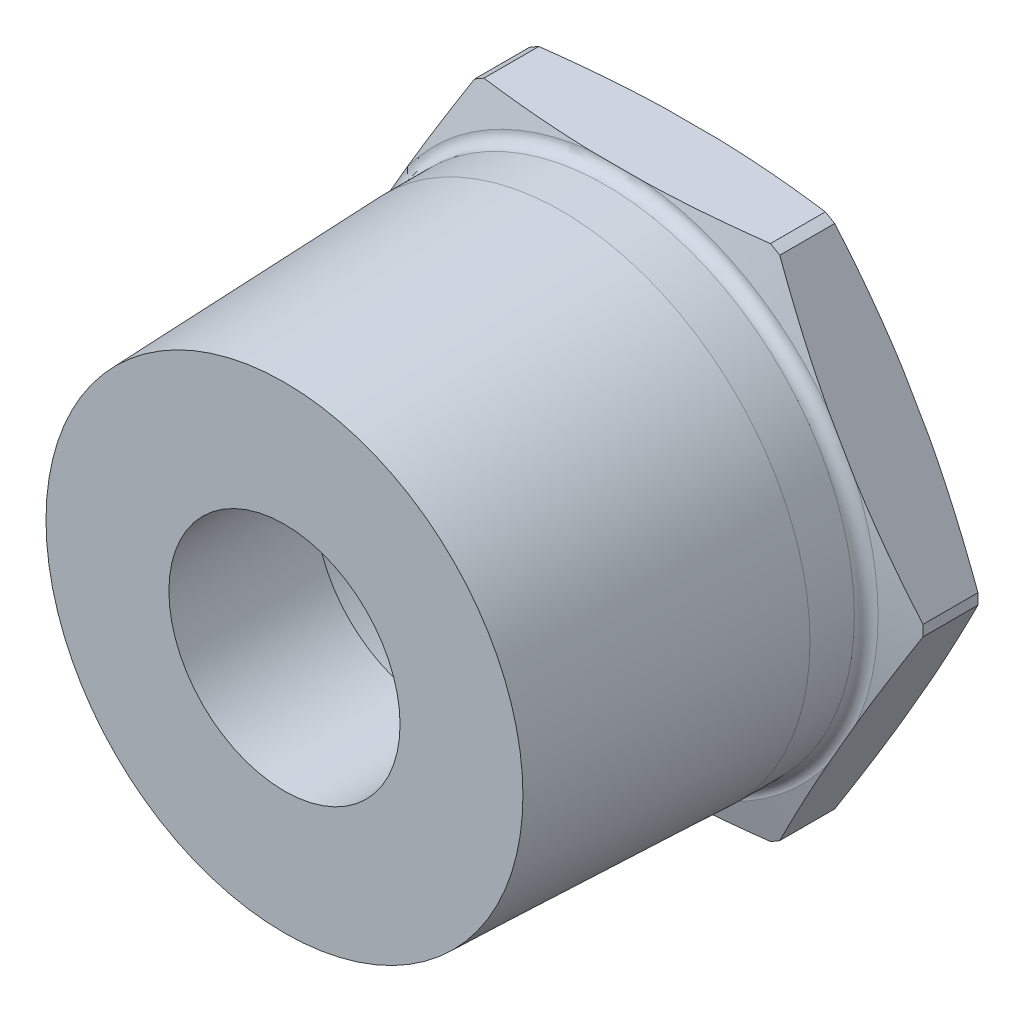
ISO-10303-21;
HEADER;
FILE_DESCRIPTION(('STEP AP214'),'2;1');
FILE_NAME('part.step','',(''),(''),'','','');
FILE_SCHEMA(('AUTOMOTIVE_DESIGN { 1 0 10303 214 1 1 1 1 }'));
ENDSEC;
DATA;
#1=APPLICATION_CONTEXT('core data for automotive mechanical design processes');
#2=APPLICATION_PROTOCOL_DEFINITION('international standard','automotive_design',2000,#1);
#3=PRODUCT_CONTEXT('',#1,'mechanical');
#4=PRODUCT('Part','Part','',(#3));
#5=PRODUCT_RELATED_PRODUCT_CATEGORY('part','',(#4));
#6=PRODUCT_DEFINITION_FORMATION('','',#4);
#7=PRODUCT_DEFINITION_CONTEXT('part definition',#1,'design');
#8=PRODUCT_DEFINITION('design','',#6,#7);
#9=PRODUCT_DEFINITION_SHAPE('','',#8);
#10=(LENGTH_UNIT() NAMED_UNIT(*) SI_UNIT(.MILLI.,.METRE.));
#11=(NAMED_UNIT(*) PLANE_ANGLE_UNIT() SI_UNIT($,.RADIAN.));
#12=(NAMED_UNIT(*) SI_UNIT($,.STERADIAN.) SOLID_ANGLE_UNIT());
#13=UNCERTAINTY_MEASURE_WITH_UNIT(LENGTH_MEASURE(1.E-05),#10,'distance_accuracy_value','');
#14=(GEOMETRIC_REPRESENTATION_CONTEXT(3) GLOBAL_UNCERTAINTY_ASSIGNED_CONTEXT((#13)) GLOBAL_UNIT_ASSIGNED_CONTEXT((#10,
#11,#12)) REPRESENTATION_CONTEXT('',''));
#15=CARTESIAN_POINT('',(0.,0.,0.));
#16=DIRECTION('',(0.,0.,1.));
#17=DIRECTION('',(1.,0.,0.));
#18=AXIS2_PLACEMENT_3D('',#15,#16,#17);
#19=CARTESIAN_POINT('',(0.,0.,0.762));
#20=DIRECTION('',(0.,0.,-1.));
#21=DIRECTION('',(-1.,0.,0.));
#22=AXIS2_PLACEMENT_3D('',#19,#20,#21);
#23=PLANE('',#22);
#24=CARTESIAN_POINT('',(0.,0.,0.762));
#25=DIRECTION('',(0.,0.,-1.));
#26=DIRECTION('',(-1.,0.,0.));
#27=AXIS2_PLACEMENT_3D('',#24,#25,#26);
#28=CIRCLE('',#27,8.5978238);
#29=CARTESIAN_POINT('',(-8.5978238,0.,0.762));
#30=VERTEX_POINT('',#29);
#31=EDGE_CURVE('E454',#30,#30,#28,.T.);
#32=ORIENTED_EDGE('',*,*,#31,.F.);
#33=EDGE_LOOP('',(#32));
#34=FACE_BOUND('',#33,.T.);
#35=CARTESIAN_POINT('',(0.,0.,0.762));
#36=DIRECTION('',(0.,0.,-1.));
#37=DIRECTION('',(-1.,0.,0.));
#38=AXIS2_PLACEMENT_3D('',#35,#36,#37);
#39=CIRCLE('',#38,11.176);
#40=CARTESIAN_POINT('',(-9.0288712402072,6.5865362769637,0.762));
#41=VERTEX_POINT('',#40);
#42=CARTESIAN_POINT('',(-1.18967211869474,11.1125,0.762));
#43=VERTEX_POINT('',#42);
#44=EDGE_CURVE('E227',#41,#43,#39,.T.);
#45=ORIENTED_EDGE('',*,*,#44,.T.);
#46=DIRECTION('',(1.,0.,0.));
#47=VECTOR('',#46,1.);
#48=CARTESIAN_POINT('',(-6.41580486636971,11.1125,0.762));
#49=LINE('',#48,#47);
#50=CARTESIAN_POINT('',(1.18967211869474,11.1125,0.762));
#51=VERTEX_POINT('',#50);
#52=EDGE_CURVE('E212',#43,#51,#49,.T.);
#53=ORIENTED_EDGE('',*,*,#52,.T.);
#54=CARTESIAN_POINT('',(9.02887124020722,6.58653627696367,0.762));
#55=VERTEX_POINT('',#54);
#56=EDGE_CURVE('E219',#51,#55,#39,.T.);
#57=ORIENTED_EDGE('',*,*,#56,.T.);
#58=DIRECTION('',(0.5,-0.866025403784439,0.));
#59=VECTOR('',#58,1.);
#60=CARTESIAN_POINT('',(6.41580486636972,11.1125,0.762));
#61=LINE('',#60,#59);
#62=CARTESIAN_POINT('',(10.2185433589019,4.52596372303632,0.762));
#63=VERTEX_POINT('',#62);
#64=EDGE_CURVE('E201',#55,#63,#61,.T.);
#65=ORIENTED_EDGE('',*,*,#64,.T.);
#66=CARTESIAN_POINT('',(10.2185433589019,-4.52596372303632,0.762));
#67=VERTEX_POINT('',#66);
#68=EDGE_CURVE('E228',#63,#67,#39,.T.);
#69=ORIENTED_EDGE('',*,*,#68,.T.);
#70=DIRECTION('',(-0.5,-0.866025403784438,0.));
#71=VECTOR('',#70,1.);
#72=CARTESIAN_POINT('',(12.8316097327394,0.,0.762));
#73=LINE('',#72,#71);
#74=CARTESIAN_POINT('',(9.02887124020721,-6.58653627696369,0.762));
#75=VERTEX_POINT('',#74);
#76=EDGE_CURVE('E211',#67,#75,#73,.T.);
#77=ORIENTED_EDGE('',*,*,#76,.T.);
#78=CARTESIAN_POINT('',(1.18967211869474,-11.1125,0.762));
#79=VERTEX_POINT('',#78);
#80=EDGE_CURVE('E232',#75,#79,#39,.T.);
#81=ORIENTED_EDGE('',*,*,#80,.T.);
#82=DIRECTION('',(-1.,0.,0.));
#83=VECTOR('',#82,1.);
#84=CARTESIAN_POINT('',(6.41580486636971,-11.1125,0.762));
#85=LINE('',#84,#83);
#86=CARTESIAN_POINT('',(-1.18967211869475,-11.1125,0.762));
#87=VERTEX_POINT('',#86);
#88=EDGE_CURVE('E444',#79,#87,#85,.T.);
#89=ORIENTED_EDGE('',*,*,#88,.T.);
#90=CARTESIAN_POINT('',(-9.02887124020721,-6.58653627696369,0.762));
#91=VERTEX_POINT('',#90);
#92=EDGE_CURVE('E236',#87,#91,#39,.T.);
#93=ORIENTED_EDGE('',*,*,#92,.T.);
#94=DIRECTION('',(-0.5,0.866025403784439,0.));
#95=VECTOR('',#94,1.);
#96=CARTESIAN_POINT('',(-6.41580486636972,-11.1125,0.762));
#97=LINE('',#96,#95);
#98=CARTESIAN_POINT('',(-10.2185433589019,-4.5259637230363,0.762));
#99=VERTEX_POINT('',#98);
#100=EDGE_CURVE('E440',#91,#99,#97,.T.);
#101=ORIENTED_EDGE('',*,*,#100,.T.);
#102=CARTESIAN_POINT('',(-10.2185433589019,4.52596372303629,0.762));
#103=VERTEX_POINT('',#102);
#104=EDGE_CURVE('E231',#99,#103,#39,.T.);
#105=ORIENTED_EDGE('',*,*,#104,.T.);
#106=DIRECTION('',(0.5,0.866025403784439,0.));
#107=VECTOR('',#106,1.);
#108=CARTESIAN_POINT('',(-12.8316097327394,0.,0.762));
#109=LINE('',#108,#107);
#110=EDGE_CURVE('E437',#103,#41,#109,.T.);
#111=ORIENTED_EDGE('',*,*,#110,.T.);
#112=EDGE_LOOP('',(#45,#53,#57,#65,#69,#77,#81,#89,#93,#101,#105,#111));
#113=FACE_BOUND('',#112,.T.);
#114=ADVANCED_FACE('F36',(#34,#113),#23,.T.);
#115=CARTESIAN_POINT('',(0.,0.,4.445));
#116=DIRECTION('',(0.,0.,-1.));
#117=DIRECTION('',(-1.,0.,0.));
#118=AXIS2_PLACEMENT_3D('',#115,#116,#117);
#119=TOROIDAL_SURFACE('',#118,11.176,0.508);
#120=CARTESIAN_POINT('',(0.,0.,4.445));
#121=DIRECTION('',(0.,0.,-1.));
#122=DIRECTION('',(-1.,0.,0.));
#123=AXIS2_PLACEMENT_3D('',#120,#121,#122);
#124=CIRCLE('',#123,10.668);
#125=CARTESIAN_POINT('',(-10.668,0.,4.445));
#126=VERTEX_POINT('',#125);
#127=EDGE_CURVE('E477',#126,#126,#124,.T.);
#128=ORIENTED_EDGE('',*,*,#127,.T.);
#129=EDGE_LOOP('',(#128));
#130=FACE_BOUND('',#129,.T.);
#131=CARTESIAN_POINT('',(0.,0.,3.937));
#132=DIRECTION('',(0.,0.,-1.));
#133=DIRECTION('',(-1.,0.,0.));
#134=AXIS2_PLACEMENT_3D('',#131,#132,#133);
#135=CIRCLE('',#134,11.176);
#136=CARTESIAN_POINT('',(1.18967211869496,11.1125,3.937));
#137=VERTEX_POINT('',#136);
#138=CARTESIAN_POINT('',(9.02887124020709,6.58653627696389,3.93699999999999));
#139=VERTEX_POINT('',#138);
#140=EDGE_CURVE('E554',#137,#139,#135,.T.);
#141=ORIENTED_EDGE('',*,*,#140,.F.);
#142=CARTESIAN_POINT('',(0.,11.1125,3.94098437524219));
#143=CARTESIAN_POINT('',(-0.169279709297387,11.1125,3.94098293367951));
#144=CARTESIAN_POINT('',(-0.338559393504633,11.1125,3.94045236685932));
#145=CARTESIAN_POINT('',(-0.677225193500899,11.1125,3.9388638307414));
#146=CARTESIAN_POINT('',(-0.846611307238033,11.1125,3.93780552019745));
#147=CARTESIAN_POINT('',(-1.13131634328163,11.1125,3.93693838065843));
#148=CARTESIAN_POINT('',(-1.24663388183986,11.1125,3.93683853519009));
#149=CARTESIAN_POINT('',(-1.47726276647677,11.1125,3.93792176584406));
#150=CARTESIAN_POINT('',(-1.59257411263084,11.1125,3.93910479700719));
#151=CARTESIAN_POINT('',(-1.82316843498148,11.1125,3.9437638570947));
#152=CARTESIAN_POINT('',(-1.93845140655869,11.1125,3.94724014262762));
#153=CARTESIAN_POINT('',(-2.16884150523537,11.1125,3.95783013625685));
#154=CARTESIAN_POINT('',(-2.28394867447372,11.1125,3.9649427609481));
#155=CARTESIAN_POINT('',(-2.45644643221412,11.1125,3.97985161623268));
#156=CARTESIAN_POINT('',(-2.51401674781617,11.1125,3.98554125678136));
#157=CARTESIAN_POINT('',(-2.62894989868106,11.1125,3.99870713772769));
#158=CARTESIAN_POINT('',(-2.6863127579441,11.1125,4.00618316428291));
#159=CARTESIAN_POINT('',(-2.80068444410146,11.1125,4.02339640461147));
#160=CARTESIAN_POINT('',(-2.85769340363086,11.1125,4.03313271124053));
#161=CARTESIAN_POINT('',(-2.9711008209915,11.1125,4.05555900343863));
#162=CARTESIAN_POINT('',(-3.0274996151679,11.1125,4.06824726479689));
#163=CARTESIAN_POINT('',(-3.1395067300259,11.1125,4.09770398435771));
#164=CARTESIAN_POINT('',(-3.1951114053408,11.1125,4.11448719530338));
#165=CARTESIAN_POINT('',(-3.27693100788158,11.1125,4.14420588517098));
#166=CARTESIAN_POINT('',(-3.30396190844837,11.1125,4.154880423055));
#167=CARTESIAN_POINT('',(-3.35716005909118,11.1125,4.17817962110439));
#168=CARTESIAN_POINT('',(-3.38332817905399,11.1125,4.19080223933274));
#169=CARTESIAN_POINT('',(-3.43451702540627,11.1125,4.21875860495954));
#170=CARTESIAN_POINT('',(-3.45952427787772,11.1125,4.23411728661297));
#171=CARTESIAN_POINT('',(-3.50687225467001,11.1125,4.26844680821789));
#172=CARTESIAN_POINT('',(-3.52923180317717,11.1125,4.28738930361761));
#173=CARTESIAN_POINT('',(-3.55632738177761,11.1125,4.31704713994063));
#174=CARTESIAN_POINT('',(-3.563406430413,11.1125,4.32559913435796));
#175=CARTESIAN_POINT('',(-3.57646542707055,11.1125,4.34352911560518));
#176=CARTESIAN_POINT('',(-3.58244466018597,11.1125,4.35290763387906));
#177=CARTESIAN_POINT('',(-3.59296978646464,11.1125,4.37260706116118));
#178=CARTESIAN_POINT('',(-3.59749705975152,11.1125,4.38293818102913));
#179=CARTESIAN_POINT('',(-3.60452738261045,11.1125,4.40426506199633));
#180=CARTESIAN_POINT('',(-3.6070351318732,11.1125,4.4152592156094));
#181=CARTESIAN_POINT('',(-3.60956308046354,11.1125,4.43656519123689));
#182=CARTESIAN_POINT('',(-3.60978072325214,11.1125,4.4468531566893));
#183=CARTESIAN_POINT('',(-3.6082111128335,11.1125,4.46727608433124));
#184=CARTESIAN_POINT('',(-3.60642265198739,11.1125,4.47741095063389));
#185=CARTESIAN_POINT('',(-3.60085880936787,11.1125,4.49795877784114));
#186=CARTESIAN_POINT('',(-3.59693924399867,11.1125,4.50833170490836));
#187=CARTESIAN_POINT('',(-3.58747296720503,11.1125,4.528301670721));
#188=CARTESIAN_POINT('',(-3.58192353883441,11.1125,4.53789737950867));
#189=CARTESIAN_POINT('',(-3.56607840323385,11.1125,4.56156327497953));
#190=CARTESIAN_POINT('',(-3.55488970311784,11.1125,4.57502834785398));
#191=CARTESIAN_POINT('',(-3.53067639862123,11.1125,4.60017470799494));
#192=CARTESIAN_POINT('',(-3.5176467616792,11.1125,4.61185091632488));
#193=CARTESIAN_POINT('',(-3.47605859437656,11.1125,4.64534944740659));
#194=CARTESIAN_POINT('',(-3.44565084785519,11.1125,4.6648419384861));
#195=CARTESIAN_POINT('',(-3.38266672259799,11.1125,4.69982570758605));
#196=CARTESIAN_POINT('',(-3.35008410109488,11.1125,4.71530478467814));
#197=CARTESIAN_POINT('',(-3.28825338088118,11.1125,4.74148039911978));
#198=CARTESIAN_POINT('',(-3.25915799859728,11.1125,4.75254142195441));
#199=CARTESIAN_POINT('',(-3.2003824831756,11.1125,4.77299915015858));
#200=CARTESIAN_POINT('',(-3.1707020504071,11.1125,4.78239497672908));
#201=CARTESIAN_POINT('',(-3.08096858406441,11.1125,4.80862360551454));
#202=CARTESIAN_POINT('',(-3.02033282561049,11.1125,4.82345471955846));
#203=CARTESIAN_POINT('',(-2.8979882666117,11.1125,4.84948557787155));
#204=CARTESIAN_POINT('',(-2.83627544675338,11.1125,4.86066534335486));
#205=CARTESIAN_POINT('',(-2.71250448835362,11.1125,4.88022506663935));
#206=CARTESIAN_POINT('',(-2.65044696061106,11.1125,4.88860895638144));
#207=CARTESIAN_POINT('',(-2.51587745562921,11.1125,4.90444628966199));
#208=CARTESIAN_POINT('',(-2.44332205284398,11.1125,4.91152090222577));
#209=CARTESIAN_POINT('',(-2.29802773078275,11.1125,4.92348618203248));
#210=CARTESIAN_POINT('',(-2.22528878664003,11.1125,4.92837653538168));
#211=CARTESIAN_POINT('',(-2.00685685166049,11.1125,4.94057889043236));
#212=CARTESIAN_POINT('',(-1.86103004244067,11.1125,4.94541394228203));
#213=CARTESIAN_POINT('',(-1.56897108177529,11.1125,4.95142634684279));
#214=CARTESIAN_POINT('',(-1.42273881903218,11.1125,4.95259463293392));
#215=CARTESIAN_POINT('',(-1.1303195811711,11.1125,4.95322471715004));
#216=CARTESIAN_POINT('',(-0.984132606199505,11.1125,4.95268704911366));
#217=CARTESIAN_POINT('',(-0.69188154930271,11.1125,4.95130185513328));
#218=CARTESIAN_POINT('',(-0.545817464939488,11.1125,4.95045458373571));
#219=CARTESIAN_POINT('',(-0.253677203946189,11.1125,4.94928384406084));
#220=CARTESIAN_POINT('',(-0.107601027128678,11.1125,4.94896040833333));
#221=CARTESIAN_POINT('',(0.184383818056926,11.1125,4.94908754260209));
#222=CARTESIAN_POINT('',(0.330292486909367,11.1125,4.94953722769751));
#223=CARTESIAN_POINT('',(0.62210549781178,11.1125,4.95085467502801));
#224=CARTESIAN_POINT('',(0.768009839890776,11.1125,4.95172243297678));
#225=CARTESIAN_POINT('',(1.05942265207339,11.1125,4.95294614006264));
#226=CARTESIAN_POINT('',(1.20493111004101,11.1125,4.95330348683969));
#227=CARTESIAN_POINT('',(1.49603139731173,11.1125,4.95203995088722));
#228=CARTESIAN_POINT('',(1.64162322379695,11.1125,4.95041787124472));
#229=CARTESIAN_POINT('',(1.93250397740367,11.1125,4.94313423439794));
#230=CARTESIAN_POINT('',(2.07779301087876,11.1125,4.93747927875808));
#231=CARTESIAN_POINT('',(2.29534053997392,11.1125,4.92363389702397));
#232=CARTESIAN_POINT('',(2.3677653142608,11.1125,4.91812797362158));
#233=CARTESIAN_POINT('',(2.51239196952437,11.1125,4.90475053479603));
#234=CARTESIAN_POINT('',(2.58459389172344,11.1125,4.89687948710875));
#235=CARTESIAN_POINT('',(2.70322440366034,11.1125,4.88131342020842));
#236=CARTESIAN_POINT('',(2.74977214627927,11.1125,4.8745331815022));
#237=CARTESIAN_POINT('',(2.84262140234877,11.1125,4.85934358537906));
#238=CARTESIAN_POINT('',(2.88892282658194,11.1125,4.85093367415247));
#239=CARTESIAN_POINT('',(2.98111406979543,11.1125,4.83208023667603));
#240=CARTESIAN_POINT('',(3.02700393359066,11.1125,4.82163693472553));
#241=CARTESIAN_POINT('',(3.11808021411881,11.1125,4.79812608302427));
#242=CARTESIAN_POINT('',(3.16326709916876,11.1125,4.78506036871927));
#243=CARTESIAN_POINT('',(3.25272876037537,11.1125,4.75530273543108));
#244=CARTESIAN_POINT('',(3.29699834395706,11.1125,4.73859430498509));
#245=CARTESIAN_POINT('',(3.36165362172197,11.1125,4.70956225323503));
#246=CARTESIAN_POINT('',(3.38292227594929,11.1125,4.69921824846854));
#247=CARTESIAN_POINT('',(3.42454447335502,11.1125,4.67684592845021));
#248=CARTESIAN_POINT('',(3.44489907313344,11.1125,4.66481962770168));
#249=CARTESIAN_POINT('',(3.48437716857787,11.1125,4.63844691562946));
#250=CARTESIAN_POINT('',(3.50348555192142,11.1125,4.6240775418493));
#251=CARTESIAN_POINT('',(3.5390547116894,11.1125,4.59240229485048));
#252=CARTESIAN_POINT('',(3.55553388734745,11.1125,4.57511874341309));
#253=CARTESIAN_POINT('',(3.57561166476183,11.1125,4.54768070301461));
#254=CARTESIAN_POINT('',(3.58122709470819,11.1125,4.53901591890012));
#255=CARTESIAN_POINT('',(3.59119647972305,11.1125,4.5209746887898));
#256=CARTESIAN_POINT('',(3.59555066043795,11.1125,4.51159837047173));
#257=CARTESIAN_POINT('',(3.6026743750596,11.1125,4.49212490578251));
#258=CARTESIAN_POINT('',(3.60542540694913,11.1125,4.48202079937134));
#259=CARTESIAN_POINT('',(3.60893083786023,11.1125,4.46147415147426));
#260=CARTESIAN_POINT('',(3.60968809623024,11.1125,4.45103211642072));
#261=CARTESIAN_POINT('',(3.60914039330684,11.1125,4.43133090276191));
#262=CARTESIAN_POINT('',(3.60804808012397,11.1125,4.42206507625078));
#263=CARTESIAN_POINT('',(3.60431973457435,11.1125,4.40384956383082));
#264=CARTESIAN_POINT('',(3.60168231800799,11.1125,4.3949001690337));
#265=CARTESIAN_POINT('',(3.59404889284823,11.1125,4.37471849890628));
#266=CARTESIAN_POINT('',(3.58856832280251,11.1125,4.36367152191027));
#267=CARTESIAN_POINT('',(3.57593480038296,11.1125,4.3425848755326));
#268=CARTESIAN_POINT('',(3.56877810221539,11.1125,4.33254753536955));
#269=CARTESIAN_POINT('',(3.54784866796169,11.1125,4.30672448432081));
#270=CARTESIAN_POINT('',(3.53296011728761,11.1125,4.29185421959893));
#271=CARTESIAN_POINT('',(3.50126148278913,11.1125,4.26435625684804));
#272=CARTESIAN_POINT('',(3.48444597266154,11.1125,4.25173516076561));
#273=CARTESIAN_POINT('',(3.44288031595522,11.1125,4.22366471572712));
#274=CARTESIAN_POINT('',(3.41758911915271,11.1125,4.20902634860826));
#275=CARTESIAN_POINT('',(3.36573406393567,11.1125,4.18216993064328));
#276=CARTESIAN_POINT('',(3.33916764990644,11.1125,4.16995701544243));
#277=CARTESIAN_POINT('',(3.2851276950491,11.1125,4.14733563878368));
#278=CARTESIAN_POINT('',(3.25765023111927,11.1125,4.13693666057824));
#279=CARTESIAN_POINT('',(3.20221470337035,11.1125,4.11763572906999));
#280=CARTESIAN_POINT('',(3.1742571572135,11.1125,4.10873226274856));
#281=CARTESIAN_POINT('',(3.09550334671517,11.1125,4.08548623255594));
#282=CARTESIAN_POINT('',(3.04431275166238,11.1125,4.07248409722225));
#283=CARTESIAN_POINT('',(2.9412873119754,11.1125,4.04930112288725));
#284=CARTESIAN_POINT('',(2.88945207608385,11.1125,4.03912209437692));
#285=CARTESIAN_POINT('',(2.7852938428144,11.1125,4.02092543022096));
#286=CARTESIAN_POINT('',(2.73297003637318,11.1125,4.01291248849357));
#287=CARTESIAN_POINT('',(2.62808300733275,11.1125,3.99862342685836));
#288=CARTESIAN_POINT('',(2.57551974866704,11.1125,3.99234757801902));
#289=CARTESIAN_POINT('',(2.41746381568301,11.1125,3.97559311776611));
#290=CARTESIAN_POINT('',(2.31175052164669,11.1125,3.96721085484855));
#291=CARTESIAN_POINT('',(2.10025350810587,11.1125,3.95418451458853));
#292=CARTESIAN_POINT('',(1.99447004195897,11.1125,3.94953577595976));
#293=CARTESIAN_POINT('',(1.73118964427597,11.1125,3.94104960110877));
#294=CARTESIAN_POINT('',(1.57364797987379,11.1125,3.93871512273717));
#295=CARTESIAN_POINT('',(1.25849578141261,11.1125,3.93665382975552));
#296=CARTESIAN_POINT('',(1.10088524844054,11.1125,3.93692819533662));
#297=CARTESIAN_POINT('',(0.786052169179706,11.1125,3.93816143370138));
#298=CARTESIAN_POINT('',(0.628829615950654,11.1125,3.93911863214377));
#299=CARTESIAN_POINT('',(0.31440470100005,11.1125,3.94053073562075));
#300=CARTESIAN_POINT('',(0.15720233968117,11.1125,3.94098571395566));
#301=CARTESIAN_POINT('',(0.,11.1125,3.94098437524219));
#302=B_SPLINE_CURVE_WITH_KNOTS('',3,(#142,#143,#144,#145,#146,#147,#148,#149,#150,#151,#152,
#153,#154,#155,#156,#157,#158,#159,#160,#161,#162,#163,#164,#165,#166,#167,#168,#169,#170,#171,
#172,#173,#174,#175,#176,#177,#178,#179,#180,#181,#182,#183,#184,#185,#186,#187,#188,#189,#190,
#191,#192,#193,#194,#195,#196,#197,#198,#199,#200,#201,#202,#203,#204,#205,#206,#207,#208,#209,
#210,#211,#212,#213,#214,#215,#216,#217,#218,#219,#220,#221,#222,#223,#224,#225,#226,#227,#228,
#229,#230,#231,#232,#233,#234,#235,#236,#237,#238,#239,#240,#241,#242,#243,#244,#245,#246,#247,
#248,#249,#250,#251,#252,#253,#254,#255,#256,#257,#258,#259,#260,#261,#262,#263,#264,#265,#266,
#267,#268,#269,#270,#271,#272,#273,#274,#275,#276,#277,#278,#279,#280,#281,#282,#283,#284,#285,
#286,#287,#288,#289,#290,#291,#292,#293,#294,#295,#296,#297,#298,#299,#300,#301),.UNSPECIFIED.,
.T.,.F.,(4,2,2,2,2,2,2,2,2,2,2,2,2,2,2,2,2,2,2,2,2,2,2,2,2,2,2,2,2,2,2,2,2,2,2,2,2,2,2,2,2,2,2,
2,2,2,2,2,2,2,2,2,2,2,2,2,2,2,2,2,2,2,2,2,2,2,2,2,2,2,2,2,2,2,2,2,2,2,2,4),(0.,
0.507839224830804,1.01600725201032,1.36195760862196,1.70789584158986,2.05387279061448,
2.39974671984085,2.5732777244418,2.74678796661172,2.92022869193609,3.09356836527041,
3.26754199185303,3.35467685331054,3.44172099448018,3.52960325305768,3.61681749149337,
3.65005797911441,3.68331999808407,3.71699293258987,3.75058727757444,3.78125878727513,
3.81194877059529,3.84503409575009,3.87817488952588,3.93039867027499,3.98276808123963,
4.09052451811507,4.19860479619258,4.29191674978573,4.38527780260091,4.57235103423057,
4.76043134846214,4.9482460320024,5.16690030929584,5.38558599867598,5.82320220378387,
6.26189963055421,6.70045979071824,7.13866018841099,7.57688781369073,8.01461418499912,
8.45233606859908,8.8888570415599,9.32564209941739,9.76171380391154,9.97958845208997,
10.1974200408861,10.3385145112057,10.4796570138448,10.6207839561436,10.7618124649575,
10.9034940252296,10.974393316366,11.0452084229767,11.1167645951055,11.1877956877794,
11.2186925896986,11.249583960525,11.2808251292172,11.3120214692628,11.3398689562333,
11.3677414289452,11.4045282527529,11.4413980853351,11.5041697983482,11.5671228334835,
11.6545766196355,11.7422136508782,11.8302959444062,11.9182885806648,12.0766102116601,
12.2350331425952,12.3937966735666,12.5525849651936,12.8706030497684,13.1882234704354,
13.660841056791,14.1336724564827,14.6053484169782,15.0769555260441),.UNSPECIFIED.);
#303=CARTESIAN_POINT('',(-1.18967211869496,11.1125,3.93699999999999));
#304=VERTEX_POINT('',#303);
#305=EDGE_CURVE('E497',#137,#304,#302,.T.);
#306=ORIENTED_EDGE('',*,*,#305,.T.);
#307=CARTESIAN_POINT('',(-9.02887124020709,6.58653627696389,3.937));
#308=VERTEX_POINT('',#307);
#309=EDGE_CURVE('E481',#308,#304,#135,.T.);
#310=ORIENTED_EDGE('',*,*,#309,.F.);
#311=CARTESIAN_POINT('',(-7.81897748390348,8.6821337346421,4.4452));
#312=CARTESIAN_POINT('',(-7.81895476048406,8.68217309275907,4.43495943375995));
#313=CARTESIAN_POINT('',(-7.81946482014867,8.68128964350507,4.42476298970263));
#314=CARTESIAN_POINT('',(-7.82139691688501,8.67794315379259,4.40486275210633));
#315=CARTESIAN_POINT('',(-7.82280611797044,8.67550234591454,4.39515406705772));
#316=CARTESIAN_POINT('',(-7.82681464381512,8.66855937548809,4.3741042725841));
#317=CARTESIAN_POINT('',(-7.82961679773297,8.66370590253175,4.36292116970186));
#318=CARTESIAN_POINT('',(-7.83608352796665,8.65250519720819,4.34155131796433));
#319=CARTESIAN_POINT('',(-7.83975303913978,8.64614941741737,4.33137076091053));
#320=CARTESIAN_POINT('',(-7.8504433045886,8.62763333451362,4.30529243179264));
#321=CARTESIAN_POINT('',(-7.85802366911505,8.61450375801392,4.29032435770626));
#322=CARTESIAN_POINT('',(-7.87413952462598,8.58659027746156,4.26267819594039));
#323=CARTESIAN_POINT('',(-7.88267672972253,8.57180340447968,4.25000432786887));
#324=CARTESIAN_POINT('',(-7.90385577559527,8.53512022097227,4.22171145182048));
#325=CARTESIAN_POINT('',(-7.91677591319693,8.51274188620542,4.20693587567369));
#326=CARTESIAN_POINT('',(-7.94325711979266,8.46687509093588,4.17985450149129));
#327=CARTESIAN_POINT('',(-7.95681947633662,8.44338440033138,4.16755394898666));
#328=CARTESIAN_POINT('',(-7.98440871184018,8.39559844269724,4.14478415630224));
#329=CARTESIAN_POINT('',(-7.99843778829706,8.37129936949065,4.13432569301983));
#330=CARTESIAN_POINT('',(-8.02673674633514,8.32228413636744,4.11493199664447));
#331=CARTESIAN_POINT('',(-8.04100637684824,8.2975684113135,4.10599527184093));
#332=CARTESIAN_POINT('',(-8.08132578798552,8.22773314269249,4.0826093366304));
#333=CARTESIAN_POINT('',(-8.10757532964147,8.18226760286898,4.06954246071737));
#334=CARTESIAN_POINT('',(-8.16039689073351,8.09077797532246,4.04629645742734));
#335=CARTESIAN_POINT('',(-8.1869691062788,8.04475354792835,4.03611918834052));
#336=CARTESIAN_POINT('',(-8.2403538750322,7.95228841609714,4.01797313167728));
#337=CARTESIAN_POINT('',(-8.26716680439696,7.90584706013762,4.01000883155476));
#338=CARTESIAN_POINT('',(-8.32091049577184,7.81276025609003,3.99584849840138));
#339=CARTESIAN_POINT('',(-8.34784127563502,7.76611477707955,3.98965274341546));
#340=CARTESIAN_POINT('',(-8.42901637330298,7.62551538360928,3.97312910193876));
#341=CARTESIAN_POINT('',(-8.48336983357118,7.53137242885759,3.96494973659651));
#342=CARTESIAN_POINT('',(-8.56493775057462,7.39009265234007,3.95551658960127));
#343=CARTESIAN_POINT('',(-8.59211839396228,7.34301439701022,3.95284554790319));
#344=CARTESIAN_POINT('',(-8.64649581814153,7.24882993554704,3.94828197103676));
#345=CARTESIAN_POINT('',(-8.67369259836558,7.2017237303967,3.94638940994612));
#346=CARTESIAN_POINT('',(-8.75370958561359,7.06313024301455,3.9417371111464));
#347=CARTESIAN_POINT('',(-8.80654177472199,6.97162220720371,3.93983902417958));
#348=CARTESIAN_POINT('',(-8.91221500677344,6.78859080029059,3.93749975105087));
#349=CARTESIAN_POINT('',(-8.96505605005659,6.69706742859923,3.93705865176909));
#350=CARTESIAN_POINT('',(-9.07074245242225,6.51401321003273,3.93695228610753));
#351=CARTESIAN_POINT('',(-9.12358781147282,6.42248236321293,3.93728708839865));
#352=CARTESIAN_POINT('',(-9.22927802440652,6.23942154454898,3.93820842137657));
#353=CARTESIAN_POINT('',(-9.28212287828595,6.14789157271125,3.93879495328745));
#354=CARTESIAN_POINT('',(-9.38784053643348,5.96478321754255,3.93984735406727));
#355=CARTESIAN_POINT('',(-9.44071334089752,5.87320483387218,3.94031315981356));
#356=CARTESIAN_POINT('',(-9.54645941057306,5.69004726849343,3.94090655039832));
#357=CARTESIAN_POINT('',(-9.59933267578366,5.59846808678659,3.94103413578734));
#358=CARTESIAN_POINT('',(-9.70509296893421,5.41528588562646,3.94089780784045));
#359=CARTESIAN_POINT('',(-9.75797999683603,5.32368286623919,3.94063379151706));
#360=CARTESIAN_POINT('',(-9.86375353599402,5.14047772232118,3.93982679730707));
#361=CARTESIAN_POINT('',(-9.91664004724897,5.04887559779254,3.93928381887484));
#362=CARTESIAN_POINT('',(-10.0199744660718,4.86989513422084,3.93821922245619));
#363=CARTESIAN_POINT('',(-10.0704223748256,4.78251679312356,3.93769777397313));
#364=CARTESIAN_POINT('',(-10.1713159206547,4.60776404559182,3.93702088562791));
#365=CARTESIAN_POINT('',(-10.2217615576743,4.52038963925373,3.93686542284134));
#366=CARTESIAN_POINT('',(-10.3225926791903,4.34574501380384,3.93741463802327));
#367=CARTESIAN_POINT('',(-10.3729781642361,4.2584747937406,3.938118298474));
#368=CARTESIAN_POINT('',(-10.473752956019,4.08392773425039,3.94101421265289));
#369=CARTESIAN_POINT('',(-10.5241422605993,3.99665089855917,3.94320683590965));
#370=CARTESIAN_POINT('',(-10.6249523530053,3.82204269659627,3.94989479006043));
#371=CARTESIAN_POINT('',(-10.6753730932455,3.73471141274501,3.9543931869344));
#372=CARTESIAN_POINT('',(-10.7760859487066,3.56027163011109,3.96676124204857));
#373=CARTESIAN_POINT('',(-10.8263781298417,3.47316301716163,3.97462850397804));
#374=CARTESIAN_POINT('',(-10.9017479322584,3.34261869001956,3.99016528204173));
#375=CARTESIAN_POINT('',(-10.9269200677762,3.29901927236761,3.99598533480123));
#376=CARTESIAN_POINT('',(-10.9771576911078,3.21200515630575,4.00916878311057));
#377=CARTESIAN_POINT('',(-11.0022232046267,3.16859041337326,4.01653178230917));
#378=CARTESIAN_POINT('',(-11.0522629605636,3.08191901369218,4.03318076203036));
#379=CARTESIAN_POINT('',(-11.0772368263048,3.03866300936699,4.04247143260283));
#380=CARTESIAN_POINT('',(-11.1269380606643,2.95257794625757,4.06356868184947));
#381=CARTESIAN_POINT('',(-11.1516651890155,2.90974930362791,4.07537750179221));
#382=CARTESIAN_POINT('',(-11.1761999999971,2.86725376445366,4.0887398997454));
#383=B_SPLINE_CURVE_WITH_KNOTS('',3,(#311,#312,#313,#314,#315,#316,#317,#318,#319,#320,#321,
#322,#323,#324,#325,#326,#327,#328,#329,#330,#331,#332,#333,#334,#335,#336,#337,#338,#339,#340,
#341,#342,#343,#344,#345,#346,#347,#348,#349,#350,#351,#352,#353,#354,#355,#356,#357,#358,#359,
#360,#361,#362,#363,#364,#365,#366,#367,#368,#369,#370,#371,#372,#373,#374,#375,#376,#377,#378,
#379,#380,#381,#382),.UNSPECIFIED.,.F.,.F.,(4,2,2,2,2,2,2,2,2,2,2,2,2,2,2,2,2,2,2,2,2,2,2,2,2,2,
2,2,2,2,2,2,2,2,2,4),(0.,0.0305967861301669,0.0607662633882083,0.0980814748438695,
0.135614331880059,0.199168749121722,0.262838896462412,0.351920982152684,0.441189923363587,
0.530964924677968,0.620651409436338,0.782824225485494,0.945101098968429,1.10770467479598,
1.27033380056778,1.59725101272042,1.76053022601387,1.92380400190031,2.24082965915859,
2.55787422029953,2.87494684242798,3.19202100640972,3.5092606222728,3.82649972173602,
4.14382226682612,4.46114543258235,4.7638369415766,5.06650949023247,5.36882391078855,
5.67121338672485,5.97400599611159,6.27658358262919,6.42860322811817,6.58058387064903,
6.73293871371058,6.88542972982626),.UNSPECIFIED.);
#384=CARTESIAN_POINT('',(-10.2185433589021,4.52596372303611,3.93699999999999));
#385=VERTEX_POINT('',#384);
#386=EDGE_CURVE('E326',#308,#385,#383,.T.);
#387=ORIENTED_EDGE('',*,*,#386,.T.);
#388=CARTESIAN_POINT('',(-10.2185433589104,-4.52596372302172,3.937));
#389=VERTEX_POINT('',#388);
#390=EDGE_CURVE('E484',#389,#385,#135,.T.);
#391=ORIENTED_EDGE('',*,*,#390,.F.);
#392=CARTESIAN_POINT('',(-11.1761999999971,-2.86725376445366,4.08873989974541));
#393=CARTESIAN_POINT('',(-11.1554861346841,-2.90313123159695,4.07744119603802));
#394=CARTESIAN_POINT('',(-11.134629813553,-2.93925543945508,4.06726784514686));
#395=CARTESIAN_POINT('',(-11.0927240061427,-3.01183842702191,4.04878987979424));
#396=CARTESIAN_POINT('',(-11.0716746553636,-3.04829697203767,4.04048404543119));
#397=CARTESIAN_POINT('',(-11.0294925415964,-3.12135853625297,4.02536161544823));
#398=CARTESIAN_POINT('',(-11.0083600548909,-3.15796107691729,4.01854185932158));
#399=CARTESIAN_POINT('',(-10.9660026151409,-3.23132631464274,4.00612014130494));
#400=CARTESIAN_POINT('',(-10.9447776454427,-3.26808904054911,4.00051840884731));
#401=CARTESIAN_POINT('',(-10.8810962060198,-3.3783885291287,3.98525135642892));
#402=CARTESIAN_POINT('',(-10.8385494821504,-3.45208161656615,3.97709598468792));
#403=CARTESIAN_POINT('',(-10.7533231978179,-3.5996978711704,3.96367253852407));
#404=CARTESIAN_POINT('',(-10.7106435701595,-3.67362115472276,3.95840630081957));
#405=CARTESIAN_POINT('',(-10.6256687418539,-3.82080187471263,3.95002478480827));
#406=CARTESIAN_POINT('',(-10.5833740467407,-3.89405843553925,3.94688817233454));
#407=CARTESIAN_POINT('',(-10.4987627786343,-4.04060945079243,3.94210215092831));
#408=CARTESIAN_POINT('',(-10.4564462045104,-4.11390390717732,3.94045282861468));
#409=CARTESIAN_POINT('',(-10.3294686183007,-4.33383553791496,3.93702087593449));
#410=CARTESIAN_POINT('',(-10.244799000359,-4.48048761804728,3.93675570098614));
#411=CARTESIAN_POINT('',(-10.0754368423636,-4.77383148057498,3.9375200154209));
#412=CARTESIAN_POINT('',(-9.99074430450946,-4.92052325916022,3.93854995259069));
#413=CARTESIAN_POINT('',(-9.82137146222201,-5.21388562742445,3.94021874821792));
#414=CARTESIAN_POINT('',(-9.73669115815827,-5.36055621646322,3.94085767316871));
#415=CARTESIAN_POINT('',(-9.56711937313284,-5.65426316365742,3.94107506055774));
#416=CARTESIAN_POINT('',(-9.48222789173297,-5.80129952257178,3.94065087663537));
#417=CARTESIAN_POINT('',(-9.3124339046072,-6.09539133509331,3.93916575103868));
#418=CARTESIAN_POINT('',(-9.22753139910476,-6.24244678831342,3.93810471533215));
#419=CARTESIAN_POINT('',(-9.05776858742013,-6.53648460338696,3.9368422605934));
#420=CARTESIAN_POINT('',(-8.97290828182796,-6.68346696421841,3.93664040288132));
#421=CARTESIAN_POINT('',(-8.80320527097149,-6.97740120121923,3.93956816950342));
#422=CARTESIAN_POINT('',(-8.71836256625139,-7.12435307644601,3.94269701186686));
#423=CARTESIAN_POINT('',(-8.61084819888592,-7.31057342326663,3.9511991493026));
#424=CARTESIAN_POINT('',(-8.58811370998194,-7.34995071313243,3.95325457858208));
#425=CARTESIAN_POINT('',(-8.5426600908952,-7.42867869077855,3.95799109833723));
#426=CARTESIAN_POINT('',(-8.51994096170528,-7.4680293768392,3.96067222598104));
#427=CARTESIAN_POINT('',(-8.45183961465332,-7.58598436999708,3.96981011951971));
#428=CARTESIAN_POINT('',(-8.40649008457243,-7.66453206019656,3.97736302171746));
#429=CARTESIAN_POINT('',(-8.33013349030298,-7.79678556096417,3.99360055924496));
#430=CARTESIAN_POINT('',(-8.2990690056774,-7.85059082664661,4.00119563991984));
#431=CARTESIAN_POINT('',(-8.23712437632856,-7.95788207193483,4.01891119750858));
#432=CARTESIAN_POINT('',(-8.20624417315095,-8.01136815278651,4.02903082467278));
#433=CARTESIAN_POINT('',(-8.15409105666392,-8.1017000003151,4.04906552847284));
#434=CARTESIAN_POINT('',(-8.13273606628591,-8.13868792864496,4.05811751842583));
#435=CARTESIAN_POINT('',(-8.09024146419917,-8.21229073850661,4.07829689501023));
#436=CARTESIAN_POINT('',(-8.06910214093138,-8.24890512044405,4.08942675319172));
#437=CARTESIAN_POINT('',(-8.02623921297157,-8.3231458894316,4.11495985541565));
#438=CARTESIAN_POINT('',(-8.0045341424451,-8.3607401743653,4.12949123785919));
#439=CARTESIAN_POINT('',(-7.96195769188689,-8.43448474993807,4.16260572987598));
#440=CARTESIAN_POINT('',(-7.94108409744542,-8.47063887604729,4.18117708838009));
#441=CARTESIAN_POINT('',(-7.90467271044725,-8.53370524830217,4.22051256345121));
#442=CARTESIAN_POINT('',(-7.88886847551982,-8.56107898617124,4.24021196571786));
#443=CARTESIAN_POINT('',(-7.86690022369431,-8.59912911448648,4.27463763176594));
#444=CARTESIAN_POINT('',(-7.85983070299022,-8.61137388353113,4.28701335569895));
#445=CARTESIAN_POINT('',(-7.84672743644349,-8.63406940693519,4.31381287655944));
#446=CARTESIAN_POINT('',(-7.84069021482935,-8.64452618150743,4.32822948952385));
#447=CARTESIAN_POINT('',(-7.8326490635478,-8.65845386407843,4.35247540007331));
#448=CARTESIAN_POINT('',(-7.83004422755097,-8.66296557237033,4.36150115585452));
#449=CARTESIAN_POINT('',(-7.82555537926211,-8.67074048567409,4.3802252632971));
#450=CARTESIAN_POINT('',(-7.82366881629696,-8.6740081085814,4.38992108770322));
#451=CARTESIAN_POINT('',(-7.82117070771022,-8.67833495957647,4.40720742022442));
#452=CARTESIAN_POINT('',(-7.82035415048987,-8.67974927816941,4.41467912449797));
#453=CARTESIAN_POINT('',(-7.81925024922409,-8.68166129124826,4.42982896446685));
#454=CARTESIAN_POINT('',(-7.81896664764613,-8.6821525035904,4.43750817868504));
#455=CARTESIAN_POINT('',(-7.81897748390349,-8.68213373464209,4.4452));
#456=B_SPLINE_CURVE_WITH_KNOTS('',3,(#392,#393,#394,#395,#396,#397,#398,#399,#400,#401,#402,
#403,#404,#405,#406,#407,#408,#409,#410,#411,#412,#413,#414,#415,#416,#417,#418,#419,#420,#421,
#422,#423,#424,#425,#426,#427,#428,#429,#430,#431,#432,#433,#434,#435,#436,#437,#438,#439,#440,
#441,#442,#443,#444,#445,#446,#447,#448,#449,#450,#451,#452,#453,#454,#455),.UNSPECIFIED.,.F.,
.F.,(4,2,2,2,2,2,2,2,2,2,2,2,2,2,2,2,2,2,2,2,2,2,2,2,2,2,2,2,2,2,2,4),(0.,0.12877629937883,
0.257468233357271,0.385883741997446,0.514323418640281,0.770693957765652,1.0272272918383,
1.28115123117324,1.53508995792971,2.04308300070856,2.55125173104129,3.05933402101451,
3.56868231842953,4.07810584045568,4.5872692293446,5.09631310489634,5.23285489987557,
5.36940480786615,5.64236446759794,5.83010355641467,6.01777953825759,6.14871671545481,
6.2798106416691,6.41699993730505,6.55379540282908,6.66493166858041,6.72116733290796,
6.77720975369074,6.80838110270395,6.83944070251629,6.86231246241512,6.88534423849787),.UNSPECIFIED.);
#457=CARTESIAN_POINT('',(-9.02887124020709,-6.58653627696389,3.93699999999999));
#458=VERTEX_POINT('',#457);
#459=EDGE_CURVE('E317',#389,#458,#456,.T.);
#460=ORIENTED_EDGE('',*,*,#459,.T.);
#461=CARTESIAN_POINT('',(-1.18967211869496,-11.1125,3.937));
#462=VERTEX_POINT('',#461);
#463=EDGE_CURVE('E487',#462,#458,#135,.T.);
#464=ORIENTED_EDGE('',*,*,#463,.F.);
#465=CARTESIAN_POINT('',(0.,-11.1125,3.94098437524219));
#466=CARTESIAN_POINT('',(0.169279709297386,-11.1125,3.94098293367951));
#467=CARTESIAN_POINT('',(0.338559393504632,-11.1125,3.94045236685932));
#468=CARTESIAN_POINT('',(0.677225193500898,-11.1125,3.9388638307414));
#469=CARTESIAN_POINT('',(0.846611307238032,-11.1125,3.93780552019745));
#470=CARTESIAN_POINT('',(1.13131634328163,-11.1125,3.93693838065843));
#471=CARTESIAN_POINT('',(1.24663388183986,-11.1125,3.93683853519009));
#472=CARTESIAN_POINT('',(1.47726276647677,-11.1125,3.93792176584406));
#473=CARTESIAN_POINT('',(1.59257411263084,-11.1125,3.93910479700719));
#474=CARTESIAN_POINT('',(1.82316843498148,-11.1125,3.9437638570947));
#475=CARTESIAN_POINT('',(1.93845140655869,-11.1125,3.94724014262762));
#476=CARTESIAN_POINT('',(2.16884150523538,-11.1125,3.95783013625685));
#477=CARTESIAN_POINT('',(2.28394867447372,-11.1125,3.9649427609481));
#478=CARTESIAN_POINT('',(2.45644643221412,-11.1125,3.97985161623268));
#479=CARTESIAN_POINT('',(2.51401674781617,-11.1125,3.98554125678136));
#480=CARTESIAN_POINT('',(2.62894989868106,-11.1125,3.99870713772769));
#481=CARTESIAN_POINT('',(2.6863127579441,-11.1125,4.00618316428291));
#482=CARTESIAN_POINT('',(2.80068444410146,-11.1125,4.02339640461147));
#483=CARTESIAN_POINT('',(2.85769340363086,-11.1125,4.03313271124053));
#484=CARTESIAN_POINT('',(2.9711008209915,-11.1125,4.05555900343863));
#485=CARTESIAN_POINT('',(3.0274996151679,-11.1125,4.06824726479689));
#486=CARTESIAN_POINT('',(3.1395067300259,-11.1125,4.09770398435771));
#487=CARTESIAN_POINT('',(3.1951114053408,-11.1125,4.11448719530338));
#488=CARTESIAN_POINT('',(3.27693100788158,-11.1125,4.14420588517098));
#489=CARTESIAN_POINT('',(3.30396190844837,-11.1125,4.154880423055));
#490=CARTESIAN_POINT('',(3.35716005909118,-11.1125,4.1781796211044));
#491=CARTESIAN_POINT('',(3.38332817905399,-11.1125,4.19080223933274));
#492=CARTESIAN_POINT('',(3.43451702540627,-11.1125,4.21875860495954));
#493=CARTESIAN_POINT('',(3.45952427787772,-11.1125,4.23411728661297));
#494=CARTESIAN_POINT('',(3.50687225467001,-11.1125,4.26844680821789));
#495=CARTESIAN_POINT('',(3.52923180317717,-11.1125,4.28738930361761));
#496=CARTESIAN_POINT('',(3.55632738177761,-11.1125,4.31704713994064));
#497=CARTESIAN_POINT('',(3.563406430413,-11.1125,4.32559913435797));
#498=CARTESIAN_POINT('',(3.57646542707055,-11.1125,4.34352911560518));
#499=CARTESIAN_POINT('',(3.58244466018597,-11.1125,4.35290763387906));
#500=CARTESIAN_POINT('',(3.59296978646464,-11.1125,4.37260706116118));
#501=CARTESIAN_POINT('',(3.59749705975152,-11.1125,4.38293818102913));
#502=CARTESIAN_POINT('',(3.60452738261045,-11.1125,4.40426506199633));
#503=CARTESIAN_POINT('',(3.6070351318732,-11.1125,4.4152592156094));
#504=CARTESIAN_POINT('',(3.60956308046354,-11.1125,4.4365651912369));
#505=CARTESIAN_POINT('',(3.60978072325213,-11.1125,4.4468531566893));
#506=CARTESIAN_POINT('',(3.60821111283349,-11.1125,4.46727608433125));
#507=CARTESIAN_POINT('',(3.60642265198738,-11.1125,4.47741095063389));
#508=CARTESIAN_POINT('',(3.60085880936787,-11.1125,4.49795877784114));
#509=CARTESIAN_POINT('',(3.59693924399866,-11.1125,4.50833170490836));
#510=CARTESIAN_POINT('',(3.58747296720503,-11.1125,4.528301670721));
#511=CARTESIAN_POINT('',(3.58192353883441,-11.1125,4.53789737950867));
#512=CARTESIAN_POINT('',(3.56607840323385,-11.1125,4.56156327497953));
#513=CARTESIAN_POINT('',(3.55488970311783,-11.1125,4.57502834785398));
#514=CARTESIAN_POINT('',(3.53067639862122,-11.1125,4.60017470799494));
#515=CARTESIAN_POINT('',(3.51764676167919,-11.1125,4.61185091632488));
#516=CARTESIAN_POINT('',(3.47605859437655,-11.1125,4.64534944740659));
#517=CARTESIAN_POINT('',(3.44565084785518,-11.1125,4.6648419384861));
#518=CARTESIAN_POINT('',(3.38266672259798,-11.1125,4.69982570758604));
#519=CARTESIAN_POINT('',(3.35008410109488,-11.1125,4.71530478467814));
#520=CARTESIAN_POINT('',(3.28825338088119,-11.1125,4.74148039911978));
#521=CARTESIAN_POINT('',(3.25915799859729,-11.1125,4.75254142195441));
#522=CARTESIAN_POINT('',(3.20038248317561,-11.1125,4.77299915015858));
#523=CARTESIAN_POINT('',(3.17070205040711,-11.1125,4.78239497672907));
#524=CARTESIAN_POINT('',(3.08096858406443,-11.1125,4.80862360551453));
#525=CARTESIAN_POINT('',(3.02033282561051,-11.1125,4.82345471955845));
#526=CARTESIAN_POINT('',(2.89798826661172,-11.1125,4.84948557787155));
#527=CARTESIAN_POINT('',(2.8362754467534,-11.1125,4.86066534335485));
#528=CARTESIAN_POINT('',(2.71250448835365,-11.1125,4.88022506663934));
#529=CARTESIAN_POINT('',(2.65044696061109,-11.1125,4.88860895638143));
#530=CARTESIAN_POINT('',(2.51587745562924,-11.1125,4.90444628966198));
#531=CARTESIAN_POINT('',(2.44332205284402,-11.1125,4.91152090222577));
#532=CARTESIAN_POINT('',(2.2980277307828,-11.1125,4.92348618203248));
#533=CARTESIAN_POINT('',(2.22528878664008,-11.1125,4.92837653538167));
#534=CARTESIAN_POINT('',(2.00685685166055,-11.1125,4.94057889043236));
#535=CARTESIAN_POINT('',(1.86103004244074,-11.1125,4.94541394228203));
#536=CARTESIAN_POINT('',(1.56897108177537,-11.1125,4.95142634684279));
#537=CARTESIAN_POINT('',(1.42273881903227,-11.1125,4.95259463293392));
#538=CARTESIAN_POINT('',(1.13031958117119,-11.1125,4.95322471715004));
#539=CARTESIAN_POINT('',(0.984132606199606,-11.1125,4.95268704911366));
#540=CARTESIAN_POINT('',(0.691881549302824,-11.1125,4.95130185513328));
#541=CARTESIAN_POINT('',(0.545817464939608,-11.1125,4.95045458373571));
#542=CARTESIAN_POINT('',(0.253677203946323,-11.1125,4.94928384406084));
#543=CARTESIAN_POINT('',(0.107601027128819,-11.1125,4.94896040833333));
#544=CARTESIAN_POINT('',(-0.184383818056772,-11.1125,4.94908754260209));
#545=CARTESIAN_POINT('',(-0.330292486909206,-11.1125,4.94953722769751));
#546=CARTESIAN_POINT('',(-0.622105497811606,-11.1125,4.95085467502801));
#547=CARTESIAN_POINT('',(-0.768009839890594,-11.1125,4.95172243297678));
#548=CARTESIAN_POINT('',(-1.05942265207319,-11.1125,4.95294614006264));
#549=CARTESIAN_POINT('',(-1.2049311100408,-11.1125,4.95330348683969));
#550=CARTESIAN_POINT('',(-1.49603139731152,-11.1125,4.95203995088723));
#551=CARTESIAN_POINT('',(-1.64162322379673,-11.1125,4.95041787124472));
#552=CARTESIAN_POINT('',(-1.93250397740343,-11.1125,4.94313423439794));
#553=CARTESIAN_POINT('',(-2.07779301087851,-11.1125,4.93747927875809));
#554=CARTESIAN_POINT('',(-2.29534053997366,-11.1125,4.92363389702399));
#555=CARTESIAN_POINT('',(-2.36776531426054,-11.1125,4.9181279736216));
#556=CARTESIAN_POINT('',(-2.5123919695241,-11.1125,4.90475053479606));
#557=CARTESIAN_POINT('',(-2.58459389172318,-11.1125,4.89687948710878));
#558=CARTESIAN_POINT('',(-2.70322440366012,-11.1125,4.88131342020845));
#559=CARTESIAN_POINT('',(-2.7497721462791,-11.1125,4.87453318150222));
#560=CARTESIAN_POINT('',(-2.8426214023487,-11.1125,4.85934358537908));
#561=CARTESIAN_POINT('',(-2.88892282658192,-11.1125,4.85093367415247));
#562=CARTESIAN_POINT('',(-2.9811140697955,-11.1125,4.83208023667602));
#563=CARTESIAN_POINT('',(-3.02700393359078,-11.1125,4.8216369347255));
#564=CARTESIAN_POINT('',(-3.11808021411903,-11.1125,4.79812608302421));
#565=CARTESIAN_POINT('',(-3.16326709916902,-11.1125,4.78506036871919));
#566=CARTESIAN_POINT('',(-3.25272876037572,-11.1125,4.75530273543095));
#567=CARTESIAN_POINT('',(-3.29699834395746,-11.1125,4.73859430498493));
#568=CARTESIAN_POINT('',(-3.36165362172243,-11.1125,4.70956225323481));
#569=CARTESIAN_POINT('',(-3.38292227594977,-11.1125,4.6992182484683));
#570=CARTESIAN_POINT('',(-3.42454447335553,-11.1125,4.67684592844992));
#571=CARTESIAN_POINT('',(-3.44489907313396,-11.1125,4.66481962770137));
#572=CARTESIAN_POINT('',(-3.48437716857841,-11.1125,4.63844691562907));
#573=CARTESIAN_POINT('',(-3.50348555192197,-11.1125,4.62407754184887));
#574=CARTESIAN_POINT('',(-3.53905471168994,-11.1125,4.59240229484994));
#575=CARTESIAN_POINT('',(-3.55553388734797,-11.1125,4.57511874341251));
#576=CARTESIAN_POINT('',(-3.57561166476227,-11.1125,4.54768070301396));
#577=CARTESIAN_POINT('',(-3.58122709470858,-11.1125,4.53901591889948));
#578=CARTESIAN_POINT('',(-3.59119647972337,-11.1125,4.52097468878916));
#579=CARTESIAN_POINT('',(-3.59555066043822,-11.1125,4.5115983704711));
#580=CARTESIAN_POINT('',(-3.60267437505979,-11.1125,4.49212490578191));
#581=CARTESIAN_POINT('',(-3.60542540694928,-11.1125,4.48202079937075));
#582=CARTESIAN_POINT('',(-3.60893083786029,-11.1125,4.46147415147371));
#583=CARTESIAN_POINT('',(-3.60968809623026,-11.1125,4.45103211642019));
#584=CARTESIAN_POINT('',(-3.6091403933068,-11.1125,4.43133090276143));
#585=CARTESIAN_POINT('',(-3.6080480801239,-11.1125,4.42206507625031));
#586=CARTESIAN_POINT('',(-3.60431973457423,-11.1125,4.40384956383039));
#587=CARTESIAN_POINT('',(-3.60168231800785,-11.1125,4.3949001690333));
#588=CARTESIAN_POINT('',(-3.59404889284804,-11.1125,4.37471849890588));
#589=CARTESIAN_POINT('',(-3.58856832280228,-11.1125,4.36367152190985));
#590=CARTESIAN_POINT('',(-3.57593480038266,-11.1125,4.34258487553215));
#591=CARTESIAN_POINT('',(-3.56877810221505,-11.1125,4.33254753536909));
#592=CARTESIAN_POINT('',(-3.54784866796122,-11.1125,4.3067244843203));
#593=CARTESIAN_POINT('',(-3.53296011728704,-11.1125,4.29185421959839));
#594=CARTESIAN_POINT('',(-3.50126148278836,-11.1125,4.26435625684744));
#595=CARTESIAN_POINT('',(-3.48444597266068,-11.1125,4.25173516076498));
#596=CARTESIAN_POINT('',(-3.44288031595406,-11.1125,4.2236647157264));
#597=CARTESIAN_POINT('',(-3.41758911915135,-11.1125,4.2090263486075));
#598=CARTESIAN_POINT('',(-3.36573406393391,-11.1125,4.18216993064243));
#599=CARTESIAN_POINT('',(-3.33916764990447,-11.1125,4.16995701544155));
#600=CARTESIAN_POINT('',(-3.28512769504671,-11.1125,4.14733563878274));
#601=CARTESIAN_POINT('',(-3.25765023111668,-11.1125,4.13693666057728));
#602=CARTESIAN_POINT('',(-3.20221470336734,-11.1125,4.117635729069));
#603=CARTESIAN_POINT('',(-3.17425715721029,-11.1125,4.10873226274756));
#604=CARTESIAN_POINT('',(-3.09550334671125,-11.1125,4.08548623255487));
#605=CARTESIAN_POINT('',(-3.04431275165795,-11.1125,4.07248409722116));
#606=CARTESIAN_POINT('',(-2.94128731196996,-11.1125,4.04930112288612));
#607=CARTESIAN_POINT('',(-2.8894520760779,-11.1125,4.03912209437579));
#608=CARTESIAN_POINT('',(-2.78529384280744,-11.1125,4.02092543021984));
#609=CARTESIAN_POINT('',(-2.73297003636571,-11.1125,4.01291248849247));
#610=CARTESIAN_POINT('',(-2.62808300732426,-11.1125,3.99862342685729));
#611=CARTESIAN_POINT('',(-2.57551974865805,-11.1125,3.99234757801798));
#612=CARTESIAN_POINT('',(-2.4174638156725,-11.1125,3.97559311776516));
#613=CARTESIAN_POINT('',(-2.31175052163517,-11.1125,3.96721085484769));
#614=CARTESIAN_POINT('',(-2.10025350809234,-11.1125,3.95418451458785));
#615=CARTESIAN_POINT('',(-1.99447004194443,-11.1125,3.94953577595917));
#616=CARTESIAN_POINT('',(-1.73118964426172,-11.1125,3.9410496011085));
#617=CARTESIAN_POINT('',(-1.57364797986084,-11.1125,3.93871512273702));
#618=CARTESIAN_POINT('',(-1.25849578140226,-11.1125,3.93665382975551));
#619=CARTESIAN_POINT('',(-1.10088524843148,-11.1125,3.93692819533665));
#620=CARTESIAN_POINT('',(-0.786052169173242,-11.1125,3.93816143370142));
#621=CARTESIAN_POINT('',(-0.628829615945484,-11.1125,3.9391186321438));
#622=CARTESIAN_POINT('',(-0.314404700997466,-11.1125,3.94053073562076));
#623=CARTESIAN_POINT('',(-0.157202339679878,-11.1125,3.94098571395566));
#624=CARTESIAN_POINT('',(0.,-11.1125,3.94098437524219));
#625=B_SPLINE_CURVE_WITH_KNOTS('',3,(#465,#466,#467,#468,#469,#470,#471,#472,#473,#474,#475,
#476,#477,#478,#479,#480,#481,#482,#483,#484,#485,#486,#487,#488,#489,#490,#491,#492,#493,#494,
#495,#496,#497,#498,#499,#500,#501,#502,#503,#504,#505,#506,#507,#508,#509,#510,#511,#512,#513,
#514,#515,#516,#517,#518,#519,#520,#521,#522,#523,#524,#525,#526,#527,#528,#529,#530,#531,#532,
#533,#534,#535,#536,#537,#538,#539,#540,#541,#542,#543,#544,#545,#546,#547,#548,#549,#550,#551,
#552,#553,#554,#555,#556,#557,#558,#559,#560,#561,#562,#563,#564,#565,#566,#567,#568,#569,#570,
#571,#572,#573,#574,#575,#576,#577,#578,#579,#580,#581,#582,#583,#584,#585,#586,#587,#588,#589,
#590,#591,#592,#593,#594,#595,#596,#597,#598,#599,#600,#601,#602,#603,#604,#605,#606,#607,#608,
#609,#610,#611,#612,#613,#614,#615,#616,#617,#618,#619,#620,#621,#622,#623,#624),.UNSPECIFIED.,
.T.,.F.,(4,2,2,2,2,2,2,2,2,2,2,2,2,2,2,2,2,2,2,2,2,2,2,2,2,2,2,2,2,2,2,2,2,2,2,2,2,2,2,2,2,2,2,
2,2,2,2,2,2,2,2,2,2,2,2,2,2,2,2,2,2,2,2,2,2,2,2,2,2,2,2,2,2,2,2,2,2,2,2,4),(0.,
0.507839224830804,1.01600725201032,1.36195760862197,1.70789584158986,2.05387279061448,
2.39974671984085,2.5732777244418,2.74678796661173,2.92022869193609,3.09356836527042,
3.26754199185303,3.35467685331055,3.44172099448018,3.52960325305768,3.61681749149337,
3.65005797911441,3.68331999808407,3.71699293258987,3.75058727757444,3.78125878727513,
3.81194877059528,3.84503409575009,3.87817488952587,3.93039867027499,3.98276808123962,
4.09052451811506,4.19860479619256,4.29191674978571,4.38527780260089,4.57235103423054,
4.76043134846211,4.94824603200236,5.16690030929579,5.38558599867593,5.82320220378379,
6.26189963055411,6.70045979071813,7.13866018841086,7.57688781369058,8.01461418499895,
8.45233606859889,8.88885704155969,9.32564209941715,9.76171380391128,9.9795884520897,
10.1974200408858,10.3385145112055,10.4796570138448,10.6207839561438,10.7618124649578,
10.90349402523,10.9743933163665,11.0452084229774,11.1167645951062,11.1877956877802,
11.2186925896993,11.2495839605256,11.2808251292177,11.3120214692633,11.3398689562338,
11.3677414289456,11.4045282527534,11.4413980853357,11.5041697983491,11.5671228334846,
11.6545766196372,11.7422136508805,11.8302959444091,11.9182885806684,12.0766102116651,
12.2350331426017,12.3937966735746,12.5525849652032,12.870603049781,13.1882234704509,
13.6608410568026,14.1336724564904,14.605348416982,15.0769555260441),.UNSPECIFIED.);
#626=CARTESIAN_POINT('',(1.18967211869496,-11.1125,3.93699999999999));
#627=VERTEX_POINT('',#626);
#628=EDGE_CURVE('E310',#462,#627,#625,.T.);
#629=ORIENTED_EDGE('',*,*,#628,.T.);
#630=CARTESIAN_POINT('',(9.02887124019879,-6.58653627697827,3.937));
#631=VERTEX_POINT('',#630);
#632=EDGE_CURVE('E547',#631,#627,#135,.T.);
#633=ORIENTED_EDGE('',*,*,#632,.F.);
#634=CARTESIAN_POINT('',(7.81897748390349,-8.68213373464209,4.4452));
#635=CARTESIAN_POINT('',(7.81895476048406,-8.68217309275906,4.43495943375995));
#636=CARTESIAN_POINT('',(7.81946482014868,-8.68128964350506,4.42476298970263));
#637=CARTESIAN_POINT('',(7.82139691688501,-8.67794315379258,4.40486275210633));
#638=CARTESIAN_POINT('',(7.82280611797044,-8.67550234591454,4.39515406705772));
#639=CARTESIAN_POINT('',(7.82681464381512,-8.6685593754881,4.3741042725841));
#640=CARTESIAN_POINT('',(7.82961679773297,-8.66370590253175,4.36292116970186));
#641=CARTESIAN_POINT('',(7.83608352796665,-8.65250519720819,4.34155131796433));
#642=CARTESIAN_POINT('',(7.83975303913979,-8.64614941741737,4.33137076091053));
#643=CARTESIAN_POINT('',(7.85044330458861,-8.62763333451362,4.30529243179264));
#644=CARTESIAN_POINT('',(7.85802366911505,-8.61450375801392,4.29032435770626));
#645=CARTESIAN_POINT('',(7.87413952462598,-8.58659027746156,4.26267819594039));
#646=CARTESIAN_POINT('',(7.88267672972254,-8.57180340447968,4.25000432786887));
#647=CARTESIAN_POINT('',(7.90385577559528,-8.53512022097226,4.22171145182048));
#648=CARTESIAN_POINT('',(7.91677591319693,-8.51274188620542,4.20693587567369));
#649=CARTESIAN_POINT('',(7.94325711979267,-8.46687509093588,4.17985450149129));
#650=CARTESIAN_POINT('',(7.95681947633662,-8.44338440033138,4.16755394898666));
#651=CARTESIAN_POINT('',(7.98440871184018,-8.39559844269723,4.14478415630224));
#652=CARTESIAN_POINT('',(7.99843778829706,-8.37129936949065,4.13432569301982));
#653=CARTESIAN_POINT('',(8.02673674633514,-8.32228413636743,4.11493199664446));
#654=CARTESIAN_POINT('',(8.04100637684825,-8.2975684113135,4.10599527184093));
#655=CARTESIAN_POINT('',(8.08132578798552,-8.22773314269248,4.08260933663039));
#656=CARTESIAN_POINT('',(8.10757532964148,-8.18226760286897,4.06954246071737));
#657=CARTESIAN_POINT('',(8.16039689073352,-8.09077797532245,4.04629645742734));
#658=CARTESIAN_POINT('',(8.18696910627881,-8.04475354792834,4.03611918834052));
#659=CARTESIAN_POINT('',(8.24035387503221,-7.95228841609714,4.01797313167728));
#660=CARTESIAN_POINT('',(8.26716680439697,-7.90584706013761,4.01000883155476));
#661=CARTESIAN_POINT('',(8.32091049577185,-7.81276025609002,3.99584849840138));
#662=CARTESIAN_POINT('',(8.34784127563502,-7.76611477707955,3.98965274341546));
#663=CARTESIAN_POINT('',(8.42901637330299,-7.62551538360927,3.97312910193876));
#664=CARTESIAN_POINT('',(8.48336983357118,-7.53137242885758,3.96494973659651));
#665=CARTESIAN_POINT('',(8.56493775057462,-7.39009265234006,3.95551658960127));
#666=CARTESIAN_POINT('',(8.59211839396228,-7.34301439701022,3.95284554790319));
#667=CARTESIAN_POINT('',(8.64649581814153,-7.24882993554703,3.94828197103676));
#668=CARTESIAN_POINT('',(8.67369259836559,-7.2017237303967,3.94638940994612));
#669=CARTESIAN_POINT('',(8.7537095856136,-7.06313024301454,3.9417371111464));
#670=CARTESIAN_POINT('',(8.806541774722,-6.9716222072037,3.93983902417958));
#671=CARTESIAN_POINT('',(8.91221500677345,-6.78859080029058,3.93749975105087));
#672=CARTESIAN_POINT('',(8.9650560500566,-6.69706742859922,3.93705865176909));
#673=CARTESIAN_POINT('',(9.07074245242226,-6.51401321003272,3.93695228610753));
#674=CARTESIAN_POINT('',(9.12358781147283,-6.42248236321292,3.93728708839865));
#675=CARTESIAN_POINT('',(9.22927802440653,-6.23942154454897,3.93820842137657));
#676=CARTESIAN_POINT('',(9.28212287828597,-6.14789157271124,3.93879495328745));
#677=CARTESIAN_POINT('',(9.38784053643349,-5.96478321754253,3.93984735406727));
#678=CARTESIAN_POINT('',(9.44071334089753,-5.87320483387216,3.94031315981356));
#679=CARTESIAN_POINT('',(9.54645941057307,-5.69004726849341,3.94090655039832));
#680=CARTESIAN_POINT('',(9.59933267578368,-5.59846808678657,3.94103413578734));
#681=CARTESIAN_POINT('',(9.70509296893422,-5.41528588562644,3.94089780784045));
#682=CARTESIAN_POINT('',(9.75797999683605,-5.32368286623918,3.94063379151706));
#683=CARTESIAN_POINT('',(9.86375353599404,-5.14047772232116,3.93982679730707));
#684=CARTESIAN_POINT('',(9.91664004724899,-5.04887559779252,3.93928381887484));
#685=CARTESIAN_POINT('',(10.0199744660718,-4.86989513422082,3.93821922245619));
#686=CARTESIAN_POINT('',(10.0704223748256,-4.78251679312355,3.93769777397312));
#687=CARTESIAN_POINT('',(10.1713159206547,-4.6077640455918,3.93702088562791));
#688=CARTESIAN_POINT('',(10.2217615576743,-4.52038963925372,3.93686542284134));
#689=CARTESIAN_POINT('',(10.3225926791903,-4.34574501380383,3.93741463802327));
#690=CARTESIAN_POINT('',(10.3729781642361,-4.25847479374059,3.938118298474));
#691=CARTESIAN_POINT('',(10.473752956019,-4.08392773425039,3.94101421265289));
#692=CARTESIAN_POINT('',(10.5241422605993,-3.99665089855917,3.94320683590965));
#693=CARTESIAN_POINT('',(10.6249523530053,-3.82204269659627,3.94989479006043));
#694=CARTESIAN_POINT('',(10.6753730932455,-3.73471141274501,3.95439318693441));
#695=CARTESIAN_POINT('',(10.7760859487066,-3.56027163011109,3.96676124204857));
#696=CARTESIAN_POINT('',(10.8263781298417,-3.47316301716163,3.97462850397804));
#697=CARTESIAN_POINT('',(10.9017479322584,-3.34261869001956,3.99016528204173));
#698=CARTESIAN_POINT('',(10.9269200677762,-3.29901927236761,3.99598533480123));
#699=CARTESIAN_POINT('',(10.9771576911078,-3.21200515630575,4.00916878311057));
#700=CARTESIAN_POINT('',(11.0022232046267,-3.16859041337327,4.01653178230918));
#701=CARTESIAN_POINT('',(11.0522629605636,-3.08191901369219,4.03318076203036));
#702=CARTESIAN_POINT('',(11.0772368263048,-3.038663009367,4.04247143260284));
#703=CARTESIAN_POINT('',(11.1269380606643,-2.95257794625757,4.06356868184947));
#704=CARTESIAN_POINT('',(11.1516651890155,-2.90974930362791,4.07537750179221));
#705=CARTESIAN_POINT('',(11.1761999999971,-2.86725376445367,4.0887398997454));
#706=B_SPLINE_CURVE_WITH_KNOTS('',3,(#634,#635,#636,#637,#638,#639,#640,#641,#642,#643,#644,
#645,#646,#647,#648,#649,#650,#651,#652,#653,#654,#655,#656,#657,#658,#659,#660,#661,#662,#663,
#664,#665,#666,#667,#668,#669,#670,#671,#672,#673,#674,#675,#676,#677,#678,#679,#680,#681,#682,
#683,#684,#685,#686,#687,#688,#689,#690,#691,#692,#693,#694,#695,#696,#697,#698,#699,#700,#701,
#702,#703,#704,#705),.UNSPECIFIED.,.F.,.F.,(4,2,2,2,2,2,2,2,2,2,2,2,2,2,2,2,2,2,2,2,2,2,2,2,2,2,
2,2,2,2,2,2,2,2,2,4),(0.,0.0305967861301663,0.0607662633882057,0.0980814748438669,
0.135614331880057,0.199168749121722,0.262838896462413,0.351920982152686,0.441189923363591,
0.530964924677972,0.620651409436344,0.7828242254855,0.945101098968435,1.10770467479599,
1.27033380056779,1.59725101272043,1.76053022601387,1.92380400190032,2.24082965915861,
2.55787422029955,2.874946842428,3.19202100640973,3.50926062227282,3.82649972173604,
4.14382226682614,4.46114543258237,4.76383694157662,5.06650949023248,5.36882391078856,
5.67121338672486,5.97400599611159,6.27658358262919,6.42860322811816,6.58058387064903,
6.73293871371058,6.88542972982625),.UNSPECIFIED.);
#707=CARTESIAN_POINT('',(10.218543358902,-4.52596372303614,3.93699999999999));
#708=VERTEX_POINT('',#707);
#709=EDGE_CURVE('E301',#631,#708,#706,.T.);
#710=ORIENTED_EDGE('',*,*,#709,.T.);
#711=CARTESIAN_POINT('',(10.2185433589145,4.52596372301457,3.937));
#712=VERTEX_POINT('',#711);
#713=EDGE_CURVE('E549',#712,#708,#135,.T.);
#714=ORIENTED_EDGE('',*,*,#713,.F.);
#715=CARTESIAN_POINT('',(11.1761999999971,2.86725376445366,4.08873989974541));
#716=CARTESIAN_POINT('',(11.1554861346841,2.90313123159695,4.07744119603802));
#717=CARTESIAN_POINT('',(11.134629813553,2.93925543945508,4.06726784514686));
#718=CARTESIAN_POINT('',(11.0927240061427,3.01183842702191,4.04878987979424));
#719=CARTESIAN_POINT('',(11.0716746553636,3.04829697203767,4.04048404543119));
#720=CARTESIAN_POINT('',(11.0294925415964,3.12135853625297,4.02536161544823));
#721=CARTESIAN_POINT('',(11.0083600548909,3.15796107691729,4.01854185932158));
#722=CARTESIAN_POINT('',(10.9660026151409,3.23132631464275,4.00612014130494));
#723=CARTESIAN_POINT('',(10.9447776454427,3.26808904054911,4.00051840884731));
#724=CARTESIAN_POINT('',(10.8810962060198,3.3783885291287,3.98525135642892));
#725=CARTESIAN_POINT('',(10.8385494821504,3.45208161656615,3.97709598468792));
#726=CARTESIAN_POINT('',(10.7533231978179,3.59969787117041,3.96367253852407));
#727=CARTESIAN_POINT('',(10.7106435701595,3.67362115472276,3.95840630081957));
#728=CARTESIAN_POINT('',(10.6256687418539,3.82080187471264,3.95002478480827));
#729=CARTESIAN_POINT('',(10.5833740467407,3.89405843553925,3.94688817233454));
#730=CARTESIAN_POINT('',(10.4987627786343,4.04060945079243,3.94210215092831));
#731=CARTESIAN_POINT('',(10.4564462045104,4.11390390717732,3.94045282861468));
#732=CARTESIAN_POINT('',(10.3294686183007,4.33383553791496,3.93702087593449));
#733=CARTESIAN_POINT('',(10.244799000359,4.48048761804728,3.93675570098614));
#734=CARTESIAN_POINT('',(10.0754368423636,4.77383148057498,3.9375200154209));
#735=CARTESIAN_POINT('',(9.99074430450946,4.92052325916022,3.93854995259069));
#736=CARTESIAN_POINT('',(9.82137146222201,5.21388562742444,3.94021874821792));
#737=CARTESIAN_POINT('',(9.73669115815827,5.36055621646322,3.94085767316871));
#738=CARTESIAN_POINT('',(9.56711937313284,5.65426316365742,3.94107506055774));
#739=CARTESIAN_POINT('',(9.48222789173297,5.80129952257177,3.94065087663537));
#740=CARTESIAN_POINT('',(9.3124339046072,6.09539133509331,3.93916575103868));
#741=CARTESIAN_POINT('',(9.22753139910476,6.24244678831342,3.93810471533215));
#742=CARTESIAN_POINT('',(9.05776858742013,6.53648460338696,3.9368422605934));
#743=CARTESIAN_POINT('',(8.97290828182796,6.68346696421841,3.93664040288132));
#744=CARTESIAN_POINT('',(8.80320527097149,6.97740120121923,3.93956816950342));
#745=CARTESIAN_POINT('',(8.71836256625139,7.12435307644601,3.94269701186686));
#746=CARTESIAN_POINT('',(8.61084819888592,7.31057342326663,3.9511991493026));
#747=CARTESIAN_POINT('',(8.58811370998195,7.34995071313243,3.95325457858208));
#748=CARTESIAN_POINT('',(8.5426600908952,7.42867869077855,3.95799109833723));
#749=CARTESIAN_POINT('',(8.51994096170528,7.46802937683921,3.96067222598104));
#750=CARTESIAN_POINT('',(8.45183961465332,7.58598436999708,3.96981011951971));
#751=CARTESIAN_POINT('',(8.40649008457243,7.66453206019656,3.97736302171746));
#752=CARTESIAN_POINT('',(8.33013349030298,7.79678556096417,3.99360055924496));
#753=CARTESIAN_POINT('',(8.2990690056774,7.85059082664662,4.00119563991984));
#754=CARTESIAN_POINT('',(8.23712437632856,7.95788207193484,4.01891119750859));
#755=CARTESIAN_POINT('',(8.20624417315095,8.01136815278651,4.02903082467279));
#756=CARTESIAN_POINT('',(8.15409105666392,8.10170000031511,4.04906552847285));
#757=CARTESIAN_POINT('',(8.1327360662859,8.13868792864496,4.05811751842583));
#758=CARTESIAN_POINT('',(8.09024146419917,8.21229073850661,4.07829689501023));
#759=CARTESIAN_POINT('',(8.06910214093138,8.24890512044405,4.08942675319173));
#760=CARTESIAN_POINT('',(8.02623921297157,8.32314588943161,4.11495985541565));
#761=CARTESIAN_POINT('',(8.0045341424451,8.36074017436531,4.12949123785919));
#762=CARTESIAN_POINT('',(7.96195769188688,8.43448474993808,4.16260572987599));
#763=CARTESIAN_POINT('',(7.94108409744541,8.47063887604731,4.1811770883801));
#764=CARTESIAN_POINT('',(7.90467271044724,8.53370524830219,4.22051256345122));
#765=CARTESIAN_POINT('',(7.88886847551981,8.56107898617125,4.24021196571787));
#766=CARTESIAN_POINT('',(7.86690022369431,8.59912911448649,4.27463763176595));
#767=CARTESIAN_POINT('',(7.85983070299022,8.61137388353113,4.28701335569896));
#768=CARTESIAN_POINT('',(7.84672743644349,8.63406940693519,4.31381287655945));
#769=CARTESIAN_POINT('',(7.84069021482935,8.64452618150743,4.32822948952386));
#770=CARTESIAN_POINT('',(7.8326490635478,8.65845386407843,4.35247540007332));
#771=CARTESIAN_POINT('',(7.83004422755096,8.66296557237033,4.36150115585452));
#772=CARTESIAN_POINT('',(7.82555537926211,8.67074048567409,4.3802252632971));
#773=CARTESIAN_POINT('',(7.82366881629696,8.6740081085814,4.38992108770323));
#774=CARTESIAN_POINT('',(7.82117070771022,8.67833495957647,4.40720742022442));
#775=CARTESIAN_POINT('',(7.82035415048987,8.67974927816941,4.41467912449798));
#776=CARTESIAN_POINT('',(7.81925024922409,8.68166129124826,4.42982896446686));
#777=CARTESIAN_POINT('',(7.81896664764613,8.68215250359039,4.43750817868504));
#778=CARTESIAN_POINT('',(7.81897748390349,8.68213373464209,4.4452));
#779=B_SPLINE_CURVE_WITH_KNOTS('',3,(#715,#716,#717,#718,#719,#720,#721,#722,#723,#724,#725,
#726,#727,#728,#729,#730,#731,#732,#733,#734,#735,#736,#737,#738,#739,#740,#741,#742,#743,#744,
#745,#746,#747,#748,#749,#750,#751,#752,#753,#754,#755,#756,#757,#758,#759,#760,#761,#762,#763,
#764,#765,#766,#767,#768,#769,#770,#771,#772,#773,#774,#775,#776,#777,#778),.UNSPECIFIED.,.F.,
.F.,(4,2,2,2,2,2,2,2,2,2,2,2,2,2,2,2,2,2,2,2,2,2,2,2,2,2,2,2,2,2,2,4),(0.,0.128776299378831,
0.257468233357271,0.385883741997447,0.514323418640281,0.770693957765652,1.0272272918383,
1.28115123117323,1.53508995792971,2.04308300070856,2.55125173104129,3.05933402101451,
3.56868231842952,4.07810584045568,4.5872692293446,5.09631310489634,5.23285489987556,
5.36940480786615,5.64236446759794,5.83010355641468,6.01777953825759,6.14871671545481,
6.2798106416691,6.41699993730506,6.5537954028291,6.66493166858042,6.72116733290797,
6.77720975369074,6.80838110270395,6.8394407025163,6.86231246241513,6.88534423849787),.UNSPECIFIED.);
#780=EDGE_CURVE('E223',#712,#139,#779,.T.);
#781=ORIENTED_EDGE('',*,*,#780,.T.);
#782=EDGE_LOOP('',(#141,#306,#310,#387,#391,#460,#464,#629,#633,#710,#714,#781));
#783=FACE_BOUND('',#782,.T.);
#784=ADVANCED_FACE('F288',(#130,#783),#119,.F.);
#785=CARTESIAN_POINT('',(0.,0.,-1.69911153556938));
#786=DIRECTION('',(0.,0.,-1.));
#787=DIRECTION('',(-1.,0.,0.));
#788=AXIS2_PLACEMENT_3D('',#785,#786,#787);
#789=CYLINDRICAL_SURFACE('',#788,12.7);
#790=CARTESIAN_POINT('',(0.,0.,1.17035456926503));
#791=DIRECTION('',(0.,0.,-1.));
#792=DIRECTION('',(-1.,0.,0.));
#793=AXIS2_PLACEMENT_3D('',#790,#791,#792);
#794=CIRCLE('',#793,12.7);
#795=CARTESIAN_POINT('',(6.54952676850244,10.8808868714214,1.17035456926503));
#796=VERTEX_POINT('',#795);
#797=CARTESIAN_POINT('',(6.14836106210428,11.1125,1.17035456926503));
#798=VERTEX_POINT('',#797);
#799=EDGE_CURVE('E221',#796,#798,#794,.F.);
#800=ORIENTED_EDGE('',*,*,#799,.T.);
#801=DIRECTION('',(0.,0.,-1.));
#802=VECTOR('',#801,1.);
#803=CARTESIAN_POINT('',(6.14836106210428,11.1125,-1.69911153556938));
#804=LINE('',#803,#802);
#805=CARTESIAN_POINT('',(6.14836106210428,11.1125,3.52864543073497));
#806=VERTEX_POINT('',#805);
#807=EDGE_CURVE('E489',#798,#806,#804,.F.);
#808=ORIENTED_EDGE('',*,*,#807,.T.);
#809=CARTESIAN_POINT('',(0.,0.,3.52864543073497));
#810=DIRECTION('',(0.,0.,1.));
#811=DIRECTION('',(1.,0.,0.));
#812=AXIS2_PLACEMENT_3D('',#809,#810,#811);
#813=CIRCLE('',#812,12.7);
#814=CARTESIAN_POINT('',(6.54952676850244,10.8808868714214,3.52864543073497));
#815=VERTEX_POINT('',#814);
#816=EDGE_CURVE('E241',#806,#815,#813,.F.);
#817=ORIENTED_EDGE('',*,*,#816,.T.);
#818=DIRECTION('',(0.,0.,-1.));
#819=VECTOR('',#818,1.);
#820=CARTESIAN_POINT('',(6.54952676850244,10.8808868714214,-1.69911153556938));
#821=LINE('',#820,#819);
#822=EDGE_CURVE('E57',#815,#796,#821,.T.);
#823=ORIENTED_EDGE('',*,*,#822,.T.);
#824=EDGE_LOOP('',(#800,#808,#817,#823));
#825=FACE_BOUND('',#824,.T.);
#826=ADVANCED_FACE('F292',(#825),#789,.T.);
#827=CARTESIAN_POINT('',(-6.54952676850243,10.8808868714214,3.52864543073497));
#828=VERTEX_POINT('',#827);
#829=CARTESIAN_POINT('',(-6.14836106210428,11.1125,3.52864543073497));
#830=VERTEX_POINT('',#829);
#831=EDGE_CURVE('E568',#828,#830,#813,.F.);
#832=ORIENTED_EDGE('',*,*,#831,.T.);
#833=DIRECTION('',(0.,0.,-1.));
#834=VECTOR('',#833,1.);
#835=CARTESIAN_POINT('',(-6.14836106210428,11.1125,-1.69911153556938));
#836=LINE('',#835,#834);
#837=CARTESIAN_POINT('',(-6.14836106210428,11.1125,1.17035456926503));
#838=VERTEX_POINT('',#837);
#839=EDGE_CURVE('E65',#830,#838,#836,.T.);
#840=ORIENTED_EDGE('',*,*,#839,.T.);
#841=CARTESIAN_POINT('',(-6.54952676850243,10.8808868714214,1.17035456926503));
#842=VERTEX_POINT('',#841);
#843=EDGE_CURVE('E246',#838,#842,#794,.F.);
#844=ORIENTED_EDGE('',*,*,#843,.T.);
#845=DIRECTION('',(0.,0.,-1.));
#846=VECTOR('',#845,1.);
#847=CARTESIAN_POINT('',(-6.54952676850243,10.8808868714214,-1.69911153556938));
#848=LINE('',#847,#846);
#849=EDGE_CURVE('E433',#842,#828,#848,.F.);
#850=ORIENTED_EDGE('',*,*,#849,.T.);
#851=EDGE_LOOP('',(#832,#840,#844,#850));
#852=FACE_BOUND('',#851,.T.);
#853=ADVANCED_FACE('F510',(#852),#789,.T.);
#854=CARTESIAN_POINT('',(-12.6978878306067,-0.231613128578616,3.52864543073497));
#855=VERTEX_POINT('',#854);
#856=CARTESIAN_POINT('',(-12.6978878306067,0.231613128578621,3.52864543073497));
#857=VERTEX_POINT('',#856);
#858=EDGE_CURVE('E430',#855,#857,#813,.F.);
#859=ORIENTED_EDGE('',*,*,#858,.T.);
#860=DIRECTION('',(0.,0.,-1.));
#861=VECTOR('',#860,1.);
#862=CARTESIAN_POINT('',(-12.6978878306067,0.231613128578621,-1.69911153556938));
#863=LINE('',#862,#861);
#864=CARTESIAN_POINT('',(-12.6978878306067,0.231613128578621,1.17035456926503));
#865=VERTEX_POINT('',#864);
#866=EDGE_CURVE('E336',#857,#865,#863,.T.);
#867=ORIENTED_EDGE('',*,*,#866,.T.);
#868=CARTESIAN_POINT('',(-12.6978878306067,-0.231613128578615,1.17035456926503));
#869=VERTEX_POINT('',#868);
#870=EDGE_CURVE('E243',#865,#869,#794,.F.);
#871=ORIENTED_EDGE('',*,*,#870,.T.);
#872=DIRECTION('',(0.,0.,-1.));
#873=VECTOR('',#872,1.);
#874=CARTESIAN_POINT('',(-12.6978878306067,-0.231613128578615,-1.69911153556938));
#875=LINE('',#874,#873);
#876=EDGE_CURVE('E418',#869,#855,#875,.F.);
#877=ORIENTED_EDGE('',*,*,#876,.T.);
#878=EDGE_LOOP('',(#859,#867,#871,#877));
#879=FACE_BOUND('',#878,.T.);
#880=ADVANCED_FACE('F429',(#879),#789,.T.);
#881=CARTESIAN_POINT('',(-6.14836106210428,-11.1125,3.52864543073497));
#882=VERTEX_POINT('',#881);
#883=CARTESIAN_POINT('',(-6.54952676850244,-10.8808868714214,3.52864543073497));
#884=VERTEX_POINT('',#883);
#885=EDGE_CURVE('E569',#882,#884,#813,.F.);
#886=ORIENTED_EDGE('',*,*,#885,.T.);
#887=DIRECTION('',(0.,0.,-1.));
#888=VECTOR('',#887,1.);
#889=CARTESIAN_POINT('',(-6.54952676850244,-10.8808868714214,-1.69911153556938));
#890=LINE('',#889,#888);
#891=CARTESIAN_POINT('',(-6.54952676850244,-10.8808868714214,1.17035456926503));
#892=VERTEX_POINT('',#891);
#893=EDGE_CURVE('E532',#884,#892,#890,.T.);
#894=ORIENTED_EDGE('',*,*,#893,.T.);
#895=CARTESIAN_POINT('',(-6.14836106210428,-11.1125,1.17035456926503));
#896=VERTEX_POINT('',#895);
#897=EDGE_CURVE('E247',#892,#896,#794,.F.);
#898=ORIENTED_EDGE('',*,*,#897,.T.);
#899=DIRECTION('',(0.,0.,-1.));
#900=VECTOR('',#899,1.);
#901=CARTESIAN_POINT('',(-6.14836106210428,-11.1125,-1.69911153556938));
#902=LINE('',#901,#900);
#903=EDGE_CURVE('E390',#896,#882,#902,.F.);
#904=ORIENTED_EDGE('',*,*,#903,.T.);
#905=EDGE_LOOP('',(#886,#894,#898,#904));
#906=FACE_BOUND('',#905,.T.);
#907=ADVANCED_FACE('F530',(#906),#789,.T.);
#908=CARTESIAN_POINT('',(6.54952676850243,-10.8808868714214,3.52864543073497));
#909=VERTEX_POINT('',#908);
#910=CARTESIAN_POINT('',(6.14836106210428,-11.1125,3.52864543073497));
#911=VERTEX_POINT('',#910);
#912=EDGE_CURVE('E242',#909,#911,#813,.F.);
#913=ORIENTED_EDGE('',*,*,#912,.T.);
#914=DIRECTION('',(0.,0.,-1.));
#915=VECTOR('',#914,1.);
#916=CARTESIAN_POINT('',(6.14836106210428,-11.1125,-1.69911153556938));
#917=LINE('',#916,#915);
#918=CARTESIAN_POINT('',(6.14836106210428,-11.1125,1.17035456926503));
#919=VERTEX_POINT('',#918);
#920=EDGE_CURVE('E573',#911,#919,#917,.T.);
#921=ORIENTED_EDGE('',*,*,#920,.T.);
#922=CARTESIAN_POINT('',(6.54952676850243,-10.8808868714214,1.17035456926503));
#923=VERTEX_POINT('',#922);
#924=EDGE_CURVE('E514',#919,#923,#794,.F.);
#925=ORIENTED_EDGE('',*,*,#924,.T.);
#926=DIRECTION('',(0.,0.,-1.));
#927=VECTOR('',#926,1.);
#928=CARTESIAN_POINT('',(6.54952676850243,-10.8808868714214,-1.69911153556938));
#929=LINE('',#928,#927);
#930=EDGE_CURVE('E574',#923,#909,#929,.F.);
#931=ORIENTED_EDGE('',*,*,#930,.T.);
#932=EDGE_LOOP('',(#913,#921,#925,#931));
#933=FACE_BOUND('',#932,.T.);
#934=ADVANCED_FACE('F572',(#933),#789,.T.);
#935=CARTESIAN_POINT('',(12.6978878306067,0.231613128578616,3.52864543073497));
#936=VERTEX_POINT('',#935);
#937=CARTESIAN_POINT('',(12.6978878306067,-0.231613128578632,3.52864543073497));
#938=VERTEX_POINT('',#937);
#939=EDGE_CURVE('E230',#936,#938,#813,.F.);
#940=ORIENTED_EDGE('',*,*,#939,.T.);
#941=DIRECTION('',(0.,0.,-1.));
#942=VECTOR('',#941,1.);
#943=CARTESIAN_POINT('',(12.6978878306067,-0.231613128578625,-1.69911153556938));
#944=LINE('',#943,#942);
#945=CARTESIAN_POINT('',(12.6978878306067,-0.231613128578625,1.17035456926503));
#946=VERTEX_POINT('',#945);
#947=EDGE_CURVE('E581',#938,#946,#944,.T.);
#948=ORIENTED_EDGE('',*,*,#947,.T.);
#949=CARTESIAN_POINT('',(12.6978878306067,0.231613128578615,1.17035456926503));
#950=VERTEX_POINT('',#949);
#951=EDGE_CURVE('E511',#946,#950,#794,.F.);
#952=ORIENTED_EDGE('',*,*,#951,.T.);
#953=DIRECTION('',(0.,0.,-1.));
#954=VECTOR('',#953,1.);
#955=CARTESIAN_POINT('',(12.6978878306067,0.231613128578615,-1.69911153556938));
#956=LINE('',#955,#954);
#957=EDGE_CURVE('E222',#950,#936,#956,.F.);
#958=ORIENTED_EDGE('',*,*,#957,.T.);
#959=EDGE_LOOP('',(#940,#948,#952,#958));
#960=FACE_BOUND('',#959,.T.);
#961=ADVANCED_FACE('F396',(#960),#789,.T.);
#962=CARTESIAN_POINT('',(0.,0.,0.762));
#963=DIRECTION('',(0.,0.,1.));
#964=DIRECTION('',(1.,0.,0.));
#965=AXIS2_PLACEMENT_3D('',#962,#963,#964);
#966=CONICAL_SURFACE('',#965,11.176,1.30899693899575);
#967=ORIENTED_EDGE('',*,*,#843,.F.);
#968=CARTESIAN_POINT('',(-14.11886837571,11.1125,2.58176981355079));
#969=CARTESIAN_POINT('',(-13.7392950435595,11.1125,2.50186280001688));
#970=CARTESIAN_POINT('',(-13.359475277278,11.1125,2.42310956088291));
#971=CARTESIAN_POINT('',(-12.5992605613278,11.1125,2.26836748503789));
#972=CARTESIAN_POINT('',(-12.2188655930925,11.1125,2.19237873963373));
#973=CARTESIAN_POINT('',(-11.4572348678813,11.1125,2.04358713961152));
#974=CARTESIAN_POINT('',(-11.0759987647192,11.1125,1.97078605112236));
#975=CARTESIAN_POINT('',(-10.3128218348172,11.1125,1.82898569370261));
#976=CARTESIAN_POINT('',(-9.93088101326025,11.1125,1.75998639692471));
#977=CARTESIAN_POINT('',(-9.16473532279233,11.1125,1.62619640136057));
#978=CARTESIAN_POINT('',(-8.78052740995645,11.1125,1.56142300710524));
#979=CARTESIAN_POINT('',(-8.01125809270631,11.1125,1.43716710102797));
#980=CARTESIAN_POINT('',(-7.62619667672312,11.1125,1.37768466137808));
#981=CARTESIAN_POINT('',(-6.46970850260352,11.1125,1.20851005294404));
#982=CARTESIAN_POINT('',(-5.69686289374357,11.1125,1.10807000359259));
#983=CARTESIAN_POINT('',(-4.54251785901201,11.1125,0.982810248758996));
#984=CARTESIAN_POINT('',(-4.16235459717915,11.1125,0.945542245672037));
#985=CARTESIAN_POINT('',(-3.40127002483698,11.1125,0.87984075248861));
#986=CARTESIAN_POINT('',(-3.0203487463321,11.1125,0.851406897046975));
#987=CARTESIAN_POINT('',(-2.25793542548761,11.1125,0.804204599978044));
#988=CARTESIAN_POINT('',(-1.87644343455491,11.1125,0.785435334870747));
#989=CARTESIAN_POINT('',(-1.11309008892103,11.1125,0.75816863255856));
#990=CARTESIAN_POINT('',(-0.731228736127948,11.1125,0.74967114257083));
#991=CARTESIAN_POINT('',(0.0317944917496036,11.1125,0.743247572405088));
#992=CARTESIAN_POINT('',(0.41295618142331,11.1125,0.745299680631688));
#993=CARTESIAN_POINT('',(1.17508033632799,11.1125,0.759853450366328));
#994=CARTESIAN_POINT('',(1.55604280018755,11.1125,0.772355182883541));
#995=CARTESIAN_POINT('',(2.31752905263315,11.1125,0.807387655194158));
#996=CARTESIAN_POINT('',(2.69805280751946,11.1125,0.829919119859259));
#997=CARTESIAN_POINT('',(3.45842140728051,11.1125,0.884307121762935));
#998=CARTESIAN_POINT('',(3.83826626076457,11.1125,0.916163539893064));
#999=CARTESIAN_POINT('',(4.63167264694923,11.1125,0.991600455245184));
#1000=CARTESIAN_POINT('',(5.04515734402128,11.1125,1.03598396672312));
#1001=CARTESIAN_POINT('',(5.87103351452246,11.1125,1.13354203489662));
#1002=CARTESIAN_POINT('',(6.28342510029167,11.1125,1.18671564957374));
#1003=CARTESIAN_POINT('',(7.10752773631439,11.1125,1.30067236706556));
#1004=CARTESIAN_POINT('',(7.51923783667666,11.1125,1.36146229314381));
#1005=CARTESIAN_POINT('',(8.34166199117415,11.1125,1.48947290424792));
#1006=CARTESIAN_POINT('',(8.75237601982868,11.1125,1.5566937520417));
#1007=CARTESIAN_POINT('',(9.57764929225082,11.1125,1.69737027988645));
#1008=CARTESIAN_POINT('',(9.99219767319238,11.1125,1.77088940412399));
#1009=CARTESIAN_POINT('',(10.8204389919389,11.1125,1.92258463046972));
#1010=CARTESIAN_POINT('',(11.2341319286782,11.1125,2.00076073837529));
#1011=CARTESIAN_POINT('',(12.0600537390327,11.1125,2.16087824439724));
#1012=CARTESIAN_POINT('',(12.4722839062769,11.1125,2.24281299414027));
#1013=CARTESIAN_POINT('',(13.2960618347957,11.1125,2.40997234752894));
#1014=CARTESIAN_POINT('',(13.7076096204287,11.1125,2.49519683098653));
#1015=CARTESIAN_POINT('',(14.11886837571,11.1125,2.58176981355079));
#1016=B_SPLINE_CURVE_WITH_KNOTS('',3,(#968,#969,#970,#971,#972,#973,#974,#975,#976,#977,#978,
#979,#980,#981,#982,#983,#984,#985,#986,#987,#988,#989,#990,#991,#992,#993,#994,#995,#996,#997,
#998,#999,#1000,#1001,#1002,#1003,#1004,#1005,#1006,#1007,#1008,#1009,#1010,#1011,#1012,#1013,
#1014,#1015),.UNSPECIFIED.,.F.,.F.,(4,2,2,2,2,2,2,2,2,2,2,2,2,2,2,2,2,2,2,2,2,2,2,4),(0.,
1.16368258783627,2.32740357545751,3.49176137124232,4.65611063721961,5.82496197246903,
6.99382924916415,9.3312136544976,10.4770882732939,11.622915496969,12.7686450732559,
13.9143687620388,15.0577245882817,16.2010881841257,17.3445344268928,18.4879660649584,
19.7354357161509,20.9827717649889,22.2312333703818,23.4797265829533,24.7427464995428,
26.0057679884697,27.2666356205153,28.527457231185),.UNSPECIFIED.);
#1017=EDGE_CURVE('E491',#838,#43,#1016,.T.);
#1018=ORIENTED_EDGE('',*,*,#1017,.T.);
#1019=ORIENTED_EDGE('',*,*,#44,.F.);
#1020=CARTESIAN_POINT('',(-17.2563678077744,-7.66390579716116,2.82672961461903));
#1021=CARTESIAN_POINT('',(-17.0572336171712,-7.31899526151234,2.74046745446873));
#1022=CARTESIAN_POINT('',(-16.8579798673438,-6.97387764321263,2.65529478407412));
#1023=CARTESIAN_POINT('',(-16.4591904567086,-6.28315412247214,2.48757681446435));
#1024=CARTESIAN_POINT('',(-16.259654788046,-5.93754820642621,2.40503159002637));
#1025=CARTESIAN_POINT('',(-15.8601753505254,-5.24562952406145,2.24298343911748));
#1026=CARTESIAN_POINT('',(-15.6602314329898,-4.89931650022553,2.1634819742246));
#1027=CARTESIAN_POINT('',(-15.2599898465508,-4.20607773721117,2.00813230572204));
#1028=CARTESIAN_POINT('',(-15.0596921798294,-3.85915200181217,1.93228407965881));
#1029=CARTESIAN_POINT('',(-14.657685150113,-3.1628554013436,1.78454105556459));
#1030=CARTESIAN_POINT('',(-14.4559737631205,-2.81348103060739,1.71266813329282));
#1031=CARTESIAN_POINT('',(-14.0521084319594,-2.11396575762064,1.57411274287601));
#1032=CARTESIAN_POINT('',(-13.8499544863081,-1.76382485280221,1.5074302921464));
#1033=CARTESIAN_POINT('',(-13.2427771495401,-0.712162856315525,1.31656367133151));
#1034=CARTESIAN_POINT('',(-12.8370005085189,-0.00933709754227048,1.20154601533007));
#1035=CARTESIAN_POINT('',(-12.2311422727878,1.04004014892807,1.05517787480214));
#1036=CARTESIAN_POINT('',(-12.0318243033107,1.38526899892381,1.01109354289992));
#1037=CARTESIAN_POINT('',(-11.6327373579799,2.07650786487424,0.932092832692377));
#1038=CARTESIAN_POINT('',(-11.4329684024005,2.42251784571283,0.897176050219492));
#1039=CARTESIAN_POINT('',(-11.0330723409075,3.11515814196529,0.837558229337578));
#1040=CARTESIAN_POINT('',(-10.8329452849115,3.46178837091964,0.812855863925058));
#1041=CARTESIAN_POINT('',(-10.4324246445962,4.15551046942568,0.774507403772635));
#1042=CARTESIAN_POINT('',(-10.2320310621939,4.50260233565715,0.760861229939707));
#1043=CARTESIAN_POINT('',(-9.83163759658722,5.19610416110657,0.745152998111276));
#1044=CARTESIAN_POINT('',(-9.63163800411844,5.54251361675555,0.74306164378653));
#1045=CARTESIAN_POINT('',(-9.23169195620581,6.23524049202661,0.750464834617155));
#1046=CARTESIAN_POINT('',(-9.03174550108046,6.581557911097,0.759959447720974));
#1047=CARTESIAN_POINT('',(-8.63204904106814,7.27385248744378,0.79017744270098));
#1048=CARTESIAN_POINT('',(-8.43229905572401,7.61982961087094,0.810901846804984));
#1049=CARTESIAN_POINT('',(-8.03314714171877,8.31118100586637,0.862847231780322));
#1050=CARTESIAN_POINT('',(-7.83374520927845,8.65655528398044,0.894068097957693));
#1051=CARTESIAN_POINT('',(-7.39861494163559,9.4102230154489,0.972663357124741));
#1052=CARTESIAN_POINT('',(-7.16297362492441,9.81836574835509,1.02195550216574));
#1053=CARTESIAN_POINT('',(-6.69239872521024,10.6334253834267,1.1320412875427));
#1054=CARTESIAN_POINT('',(-6.45746506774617,11.0403424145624,1.19283367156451));
#1055=CARTESIAN_POINT('',(-5.98797026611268,11.8535312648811,1.32418062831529));
#1056=CARTESIAN_POINT('',(-5.75341002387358,12.2598015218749,1.39474798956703));
#1057=CARTESIAN_POINT('',(-5.28492822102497,13.0712358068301,1.54392163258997));
#1058=CARTESIAN_POINT('',(-5.05100667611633,13.4763998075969,1.62252811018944));
#1059=CARTESIAN_POINT('',(-4.58055462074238,14.2912466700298,1.78746715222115));
#1060=CARTESIAN_POINT('',(-4.34403211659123,14.700915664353,1.87389058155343));
#1061=CARTESIAN_POINT('',(-3.87151310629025,15.5193425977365,2.05229405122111));
#1062=CARTESIAN_POINT('',(-3.63551660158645,15.9281005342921,2.14427410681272));
#1063=CARTESIAN_POINT('',(-3.16454665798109,16.7438444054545,2.33255194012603));
#1064=CARTESIAN_POINT('',(-2.92957212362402,17.1508322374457,2.42883880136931));
#1065=CARTESIAN_POINT('',(-2.46002566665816,17.9641105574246,2.62516268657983));
#1066=CARTESIAN_POINT('',(-2.22545372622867,18.3704010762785,2.72519953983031));
#1067=CARTESIAN_POINT('',(-1.99104679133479,18.7764057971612,2.82672961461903));
#1068=B_SPLINE_CURVE_WITH_KNOTS('',3,(#1020,#1021,#1022,#1023,#1024,#1025,#1026,#1027,#1028,
#1029,#1030,#1031,#1032,#1033,#1034,#1035,#1036,#1037,#1038,#1039,#1040,#1041,#1042,#1043,#1044,
#1045,#1046,#1047,#1048,#1049,#1050,#1051,#1052,#1053,#1054,#1055,#1056,#1057,#1058,#1059,#1060,
#1061,#1062,#1063,#1064,#1065,#1066,#1067),.UNSPECIFIED.,.F.,.F.,(4,2,2,2,2,2,2,2,2,2,2,2,2,2,2,
2,2,2,2,2,2,2,2,4),(0.,1.22251263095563,2.4450600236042,3.66818728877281,4.89130703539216,
6.12059747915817,7.34989204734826,9.80825076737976,11.011365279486,12.2144267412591,
13.4173318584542,14.6202283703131,15.8200736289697,17.0199259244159,18.2198874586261,
19.4198358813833,20.8412246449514,22.2624582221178,23.6855690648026,25.1087145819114,
26.5512987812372,27.9938869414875,29.4330055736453,30.8720587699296),.UNSPECIFIED.);
#1069=EDGE_CURVE('E434',#41,#842,#1068,.T.);
#1070=ORIENTED_EDGE('',*,*,#1069,.T.);
#1071=EDGE_LOOP('',(#967,#1018,#1019,#1070));
#1072=FACE_BOUND('',#1071,.T.);
#1073=ADVANCED_FACE('F392',(#1072),#966,.T.);
#1074=ORIENTED_EDGE('',*,*,#56,.F.);
#1075=EDGE_CURVE('E488',#51,#798,#1016,.T.);
#1076=ORIENTED_EDGE('',*,*,#1075,.T.);
#1077=ORIENTED_EDGE('',*,*,#799,.F.);
#1078=CARTESIAN_POINT('',(1.99104679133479,18.7764057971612,2.82672961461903));
#1079=CARTESIAN_POINT('',(2.19018098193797,18.4314952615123,2.74046745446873));
#1080=CARTESIAN_POINT('',(2.3894347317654,18.0863776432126,2.65529478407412));
#1081=CARTESIAN_POINT('',(2.78822414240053,17.3956541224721,2.48757681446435));
#1082=CARTESIAN_POINT('',(2.98775981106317,17.0500482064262,2.40503159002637));
#1083=CARTESIAN_POINT('',(3.3872392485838,16.3581295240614,2.24298343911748));
#1084=CARTESIAN_POINT('',(3.58718316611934,16.0118165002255,2.1634819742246));
#1085=CARTESIAN_POINT('',(3.98742475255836,15.3185777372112,2.00813230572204));
#1086=CARTESIAN_POINT('',(4.18772241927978,14.9716520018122,1.93228407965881));
#1087=CARTESIAN_POINT('',(4.58972944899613,14.2753554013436,1.78454105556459));
#1088=CARTESIAN_POINT('',(4.79144083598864,13.9259810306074,1.71266813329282));
#1089=CARTESIAN_POINT('',(5.1953061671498,13.2264657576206,1.57411274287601));
#1090=CARTESIAN_POINT('',(5.39746011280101,12.8763248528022,1.5074302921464));
#1091=CARTESIAN_POINT('',(6.0046374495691,11.8246628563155,1.31656367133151));
#1092=CARTESIAN_POINT('',(6.41041409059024,11.1218370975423,1.20154601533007));
#1093=CARTESIAN_POINT('',(7.01627232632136,10.0724598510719,1.05517787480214));
#1094=CARTESIAN_POINT('',(7.21559029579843,9.72723100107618,1.01109354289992));
#1095=CARTESIAN_POINT('',(7.61467724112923,9.03599213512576,0.932092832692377));
#1096=CARTESIAN_POINT('',(7.81444619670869,8.68998215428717,0.897176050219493));
#1097=CARTESIAN_POINT('',(8.21434225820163,7.99734185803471,0.837558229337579));
#1098=CARTESIAN_POINT('',(8.41446931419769,7.65071162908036,0.812855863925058));
#1099=CARTESIAN_POINT('',(8.81498995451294,6.95698953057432,0.774507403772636));
#1100=CARTESIAN_POINT('',(9.01538353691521,6.60989766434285,0.760861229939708));
#1101=CARTESIAN_POINT('',(9.41577700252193,5.91639583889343,0.745152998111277));
#1102=CARTESIAN_POINT('',(9.6157765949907,5.56998638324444,0.74306164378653));
#1103=CARTESIAN_POINT('',(10.0157226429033,4.87725950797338,0.750464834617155));
#1104=CARTESIAN_POINT('',(10.2156690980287,4.53094208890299,0.759959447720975));
#1105=CARTESIAN_POINT('',(10.615365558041,3.83864751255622,0.79017744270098));
#1106=CARTESIAN_POINT('',(10.8151155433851,3.49267038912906,0.810901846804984));
#1107=CARTESIAN_POINT('',(11.2142674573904,2.80131899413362,0.862847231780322));
#1108=CARTESIAN_POINT('',(11.4136693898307,2.45594471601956,0.894068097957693));
#1109=CARTESIAN_POINT('',(11.8487996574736,1.70227698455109,0.972663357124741));
#1110=CARTESIAN_POINT('',(12.0844409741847,1.2941342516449,1.02195550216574));
#1111=CARTESIAN_POINT('',(12.5550158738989,0.479074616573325,1.1320412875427));
#1112=CARTESIAN_POINT('',(12.789949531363,0.0721575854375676,1.19283367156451));
#1113=CARTESIAN_POINT('',(13.2594443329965,-0.741031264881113,1.32418062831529));
#1114=CARTESIAN_POINT('',(13.4940045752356,-1.1473015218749,1.39474798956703));
#1115=CARTESIAN_POINT('',(13.9624863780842,-1.95873580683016,1.54392163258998));
#1116=CARTESIAN_POINT('',(14.1964079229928,-2.36389980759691,1.62252811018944));
#1117=CARTESIAN_POINT('',(14.6668599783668,-3.17874667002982,1.78746715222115));
#1118=CARTESIAN_POINT('',(14.9033824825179,-3.58841566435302,1.87389058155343));
#1119=CARTESIAN_POINT('',(15.3759014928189,-4.40684259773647,2.05229405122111));
#1120=CARTESIAN_POINT('',(15.6118979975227,-4.81560053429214,2.14427410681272));
#1121=CARTESIAN_POINT('',(16.0828679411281,-5.63134440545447,2.33255194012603));
#1122=CARTESIAN_POINT('',(16.3178424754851,-6.03833223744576,2.42883880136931));
#1123=CARTESIAN_POINT('',(16.787388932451,-6.85161055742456,2.62516268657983));
#1124=CARTESIAN_POINT('',(17.0219608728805,-7.25790107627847,2.72519953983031));
#1125=CARTESIAN_POINT('',(17.2563678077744,-7.66390579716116,2.82672961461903));
#1126=B_SPLINE_CURVE_WITH_KNOTS('',3,(#1078,#1079,#1080,#1081,#1082,#1083,#1084,#1085,#1086,
#1087,#1088,#1089,#1090,#1091,#1092,#1093,#1094,#1095,#1096,#1097,#1098,#1099,#1100,#1101,#1102,
#1103,#1104,#1105,#1106,#1107,#1108,#1109,#1110,#1111,#1112,#1113,#1114,#1115,#1116,#1117,#1118,
#1119,#1120,#1121,#1122,#1123,#1124,#1125),.UNSPECIFIED.,.F.,.F.,(4,2,2,2,2,2,2,2,2,2,2,2,2,2,2,
2,2,2,2,2,2,2,2,4),(0.,1.22251263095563,2.44506002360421,3.66818728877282,4.89130703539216,
6.12059747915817,7.34989204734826,9.80825076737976,11.011365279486,12.214426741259,
13.4173318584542,14.6202283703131,15.8200736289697,17.0199259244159,18.2198874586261,
19.4198358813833,20.8412246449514,22.2624582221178,23.6855690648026,25.1087145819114,
26.5512987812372,27.9938869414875,29.4330055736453,30.8720587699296),.UNSPECIFIED.);
#1127=EDGE_CURVE('E204',#796,#55,#1126,.T.);
#1128=ORIENTED_EDGE('',*,*,#1127,.T.);
#1129=EDGE_LOOP('',(#1074,#1076,#1077,#1128));
#1130=FACE_BOUND('',#1129,.T.);
#1131=ADVANCED_FACE('F217',(#1130),#966,.T.);
#1132=ORIENTED_EDGE('',*,*,#870,.F.);
#1133=EDGE_CURVE('E335',#865,#103,#1068,.T.);
#1134=ORIENTED_EDGE('',*,*,#1133,.T.);
#1135=ORIENTED_EDGE('',*,*,#104,.F.);
#1136=CARTESIAN_POINT('',(-1.9910467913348,-18.7764057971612,2.82672961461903));
#1137=CARTESIAN_POINT('',(-2.19018098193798,-18.4314952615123,2.74046745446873));
#1138=CARTESIAN_POINT('',(-2.3894347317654,-18.0863776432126,2.65529478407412));
#1139=CARTESIAN_POINT('',(-2.78822414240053,-17.3956541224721,2.48757681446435));
#1140=CARTESIAN_POINT('',(-2.98775981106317,-17.0500482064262,2.40503159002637));
#1141=CARTESIAN_POINT('',(-3.3872392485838,-16.3581295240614,2.24298343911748));
#1142=CARTESIAN_POINT('',(-3.58718316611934,-16.0118165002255,2.1634819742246));
#1143=CARTESIAN_POINT('',(-3.98742475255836,-15.3185777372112,2.00813230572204));
#1144=CARTESIAN_POINT('',(-4.18772241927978,-14.9716520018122,1.93228407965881));
#1145=CARTESIAN_POINT('',(-4.58972944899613,-14.2753554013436,1.78454105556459));
#1146=CARTESIAN_POINT('',(-4.79144083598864,-13.9259810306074,1.71266813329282));
#1147=CARTESIAN_POINT('',(-5.1953061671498,-13.2264657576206,1.57411274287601));
#1148=CARTESIAN_POINT('',(-5.39746011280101,-12.8763248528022,1.5074302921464));
#1149=CARTESIAN_POINT('',(-6.0046374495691,-11.8246628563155,1.31656367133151));
#1150=CARTESIAN_POINT('',(-6.41041409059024,-11.1218370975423,1.20154601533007));
#1151=CARTESIAN_POINT('',(-7.01627232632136,-10.0724598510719,1.05517787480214));
#1152=CARTESIAN_POINT('',(-7.21559029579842,-9.72723100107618,1.01109354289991));
#1153=CARTESIAN_POINT('',(-7.61467724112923,-9.03599213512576,0.932092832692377));
#1154=CARTESIAN_POINT('',(-7.81444619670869,-8.68998215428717,0.897176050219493));
#1155=CARTESIAN_POINT('',(-8.21434225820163,-7.99734185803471,0.837558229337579));
#1156=CARTESIAN_POINT('',(-8.41446931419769,-7.65071162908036,0.812855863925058));
#1157=CARTESIAN_POINT('',(-8.81498995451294,-6.95698953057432,0.774507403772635));
#1158=CARTESIAN_POINT('',(-9.01538353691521,-6.60989766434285,0.760861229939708));
#1159=CARTESIAN_POINT('',(-9.41577700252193,-5.91639583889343,0.745152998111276));
#1160=CARTESIAN_POINT('',(-9.6157765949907,-5.56998638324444,0.74306164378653));
#1161=CARTESIAN_POINT('',(-10.0157226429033,-4.87725950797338,0.750464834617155));
#1162=CARTESIAN_POINT('',(-10.2156690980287,-4.53094208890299,0.759959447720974));
#1163=CARTESIAN_POINT('',(-10.615365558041,-3.83864751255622,0.79017744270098));
#1164=CARTESIAN_POINT('',(-10.8151155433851,-3.49267038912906,0.810901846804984));
#1165=CARTESIAN_POINT('',(-11.2142674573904,-2.80131899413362,0.862847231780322));
#1166=CARTESIAN_POINT('',(-11.4136693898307,-2.45594471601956,0.894068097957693));
#1167=CARTESIAN_POINT('',(-11.8487996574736,-1.70227698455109,0.97266335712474));
#1168=CARTESIAN_POINT('',(-12.0844409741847,-1.2941342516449,1.02195550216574));
#1169=CARTESIAN_POINT('',(-12.5550158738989,-0.479074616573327,1.1320412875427));
#1170=CARTESIAN_POINT('',(-12.789949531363,-0.0721575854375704,1.19283367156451));
#1171=CARTESIAN_POINT('',(-13.2594443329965,0.74103126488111,1.32418062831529));
#1172=CARTESIAN_POINT('',(-13.4940045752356,1.1473015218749,1.39474798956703));
#1173=CARTESIAN_POINT('',(-13.9624863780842,1.95873580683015,1.54392163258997));
#1174=CARTESIAN_POINT('',(-14.1964079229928,2.36389980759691,1.62252811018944));
#1175=CARTESIAN_POINT('',(-14.6668599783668,3.17874667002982,1.78746715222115));
#1176=CARTESIAN_POINT('',(-14.9033824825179,3.58841566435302,1.87389058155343));
#1177=CARTESIAN_POINT('',(-15.3759014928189,4.40684259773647,2.05229405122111));
#1178=CARTESIAN_POINT('',(-15.6118979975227,4.81560053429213,2.14427410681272));
#1179=CARTESIAN_POINT('',(-16.0828679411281,5.63134440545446,2.33255194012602));
#1180=CARTESIAN_POINT('',(-16.3178424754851,6.03833223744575,2.42883880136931));
#1181=CARTESIAN_POINT('',(-16.787388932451,6.85161055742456,2.62516268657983));
#1182=CARTESIAN_POINT('',(-17.0219608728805,7.25790107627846,2.72519953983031));
#1183=CARTESIAN_POINT('',(-17.2563678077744,7.66390579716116,2.82672961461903));
#1184=B_SPLINE_CURVE_WITH_KNOTS('',3,(#1136,#1137,#1138,#1139,#1140,#1141,#1142,#1143,#1144,
#1145,#1146,#1147,#1148,#1149,#1150,#1151,#1152,#1153,#1154,#1155,#1156,#1157,#1158,#1159,#1160,
#1161,#1162,#1163,#1164,#1165,#1166,#1167,#1168,#1169,#1170,#1171,#1172,#1173,#1174,#1175,#1176,
#1177,#1178,#1179,#1180,#1181,#1182,#1183),.UNSPECIFIED.,.F.,.F.,(4,2,2,2,2,2,2,2,2,2,2,2,2,2,2,
2,2,2,2,2,2,2,2,4),(0.,1.22251263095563,2.44506002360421,3.66818728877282,4.89130703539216,
6.12059747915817,7.34989204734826,9.80825076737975,11.011365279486,12.214426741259,
13.4173318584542,14.6202283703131,15.8200736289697,17.0199259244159,18.2198874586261,
19.4198358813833,20.8412246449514,22.2624582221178,23.6855690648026,25.1087145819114,
26.5512987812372,27.9938869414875,29.4330055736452,30.8720587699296),.UNSPECIFIED.);
#1185=EDGE_CURVE('E419',#99,#869,#1184,.T.);
#1186=ORIENTED_EDGE('',*,*,#1185,.T.);
#1187=EDGE_LOOP('',(#1132,#1134,#1135,#1186));
#1188=FACE_BOUND('',#1187,.T.);
#1189=ADVANCED_FACE('F432',(#1188),#966,.T.);
#1190=ORIENTED_EDGE('',*,*,#897,.F.);
#1191=EDGE_CURVE('E412',#892,#91,#1184,.T.);
#1192=ORIENTED_EDGE('',*,*,#1191,.T.);
#1193=ORIENTED_EDGE('',*,*,#92,.F.);
#1194=CARTESIAN_POINT('',(14.11886837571,-11.1125,2.58176981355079));
#1195=CARTESIAN_POINT('',(13.7392950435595,-11.1125,2.50186280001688));
#1196=CARTESIAN_POINT('',(13.359475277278,-11.1125,2.42310956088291));
#1197=CARTESIAN_POINT('',(12.5992605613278,-11.1125,2.26836748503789));
#1198=CARTESIAN_POINT('',(12.2188655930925,-11.1125,2.19237873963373));
#1199=CARTESIAN_POINT('',(11.4572348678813,-11.1125,2.04358713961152));
#1200=CARTESIAN_POINT('',(11.0759987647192,-11.1125,1.97078605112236));
#1201=CARTESIAN_POINT('',(10.3128218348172,-11.1125,1.82898569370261));
#1202=CARTESIAN_POINT('',(9.93088101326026,-11.1125,1.75998639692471));
#1203=CARTESIAN_POINT('',(9.16473532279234,-11.1125,1.62619640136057));
#1204=CARTESIAN_POINT('',(8.78052740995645,-11.1125,1.56142300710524));
#1205=CARTESIAN_POINT('',(8.01125809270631,-11.1125,1.43716710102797));
#1206=CARTESIAN_POINT('',(7.62619667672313,-11.1125,1.37768466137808));
#1207=CARTESIAN_POINT('',(6.46970850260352,-11.1125,1.20851005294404));
#1208=CARTESIAN_POINT('',(5.69686289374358,-11.1125,1.10807000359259));
#1209=CARTESIAN_POINT('',(4.54251785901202,-11.1125,0.982810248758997));
#1210=CARTESIAN_POINT('',(4.16235459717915,-11.1125,0.945542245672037));
#1211=CARTESIAN_POINT('',(3.40127002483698,-11.1125,0.879840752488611));
#1212=CARTESIAN_POINT('',(3.0203487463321,-11.1125,0.851406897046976));
#1213=CARTESIAN_POINT('',(2.25793542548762,-11.1125,0.804204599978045));
#1214=CARTESIAN_POINT('',(1.87644343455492,-11.1125,0.785435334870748));
#1215=CARTESIAN_POINT('',(1.11309008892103,-11.1125,0.75816863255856));
#1216=CARTESIAN_POINT('',(0.731228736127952,-11.1125,0.74967114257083));
#1217=CARTESIAN_POINT('',(-0.0317944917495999,-11.1125,0.743247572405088));
#1218=CARTESIAN_POINT('',(-0.412956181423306,-11.1125,0.745299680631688));
#1219=CARTESIAN_POINT('',(-1.17508033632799,-11.1125,0.759853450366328));
#1220=CARTESIAN_POINT('',(-1.55604280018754,-11.1125,0.77235518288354));
#1221=CARTESIAN_POINT('',(-2.31752905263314,-11.1125,0.807387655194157));
#1222=CARTESIAN_POINT('',(-2.69805280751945,-11.1125,0.829919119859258));
#1223=CARTESIAN_POINT('',(-3.4584214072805,-11.1125,0.884307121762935));
#1224=CARTESIAN_POINT('',(-3.83826626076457,-11.1125,0.916163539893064));
#1225=CARTESIAN_POINT('',(-4.63167264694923,-11.1125,0.991600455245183));
#1226=CARTESIAN_POINT('',(-5.04515734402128,-11.1125,1.03598396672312));
#1227=CARTESIAN_POINT('',(-5.87103351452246,-11.1125,1.13354203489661));
#1228=CARTESIAN_POINT('',(-6.28342510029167,-11.1125,1.18671564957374));
#1229=CARTESIAN_POINT('',(-7.10752773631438,-11.1125,1.30067236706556));
#1230=CARTESIAN_POINT('',(-7.51923783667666,-11.1125,1.36146229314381));
#1231=CARTESIAN_POINT('',(-8.34166199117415,-11.1125,1.48947290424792));
#1232=CARTESIAN_POINT('',(-8.75237601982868,-11.1125,1.55669375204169));
#1233=CARTESIAN_POINT('',(-9.57764929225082,-11.1125,1.69737027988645));
#1234=CARTESIAN_POINT('',(-9.99219767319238,-11.1125,1.77088940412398));
#1235=CARTESIAN_POINT('',(-10.8204389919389,-11.1125,1.92258463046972));
#1236=CARTESIAN_POINT('',(-11.2341319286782,-11.1125,2.00076073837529));
#1237=CARTESIAN_POINT('',(-12.0600537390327,-11.1125,2.16087824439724));
#1238=CARTESIAN_POINT('',(-12.4722839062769,-11.1125,2.24281299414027));
#1239=CARTESIAN_POINT('',(-13.2960618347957,-11.1125,2.40997234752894));
#1240=CARTESIAN_POINT('',(-13.7076096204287,-11.1125,2.49519683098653));
#1241=CARTESIAN_POINT('',(-14.11886837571,-11.1125,2.58176981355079));
#1242=B_SPLINE_CURVE_WITH_KNOTS('',3,(#1194,#1195,#1196,#1197,#1198,#1199,#1200,#1201,#1202,
#1203,#1204,#1205,#1206,#1207,#1208,#1209,#1210,#1211,#1212,#1213,#1214,#1215,#1216,#1217,#1218,
#1219,#1220,#1221,#1222,#1223,#1224,#1225,#1226,#1227,#1228,#1229,#1230,#1231,#1232,#1233,#1234,
#1235,#1236,#1237,#1238,#1239,#1240,#1241),.UNSPECIFIED.,.F.,.F.,(4,2,2,2,2,2,2,2,2,2,2,2,2,2,2,
2,2,2,2,2,2,2,2,4),(0.,1.16368258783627,2.32740357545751,3.49176137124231,4.6561106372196,
5.82496197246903,6.99382924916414,9.3312136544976,10.4770882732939,11.622915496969,
12.7686450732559,13.9143687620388,15.0577245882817,16.2010881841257,17.3445344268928,
18.4879660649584,19.7354357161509,20.9827717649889,22.2312333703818,23.4797265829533,
24.7427464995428,26.0057679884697,27.2666356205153,28.527457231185),.UNSPECIFIED.);
#1243=EDGE_CURVE('E391',#87,#896,#1242,.T.);
#1244=ORIENTED_EDGE('',*,*,#1243,.T.);
#1245=EDGE_LOOP('',(#1190,#1192,#1193,#1244));
#1246=FACE_BOUND('',#1245,.T.);
#1247=ADVANCED_FACE('F535',(#1246),#966,.T.);
#1248=ORIENTED_EDGE('',*,*,#924,.F.);
#1249=EDGE_CURVE('E383',#919,#79,#1242,.T.);
#1250=ORIENTED_EDGE('',*,*,#1249,.T.);
#1251=ORIENTED_EDGE('',*,*,#80,.F.);
#1252=CARTESIAN_POINT('',(17.2563678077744,7.66390579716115,2.82672961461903));
#1253=CARTESIAN_POINT('',(17.0572336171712,7.31899526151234,2.74046745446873));
#1254=CARTESIAN_POINT('',(16.8579798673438,6.97387764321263,2.65529478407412));
#1255=CARTESIAN_POINT('',(16.4591904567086,6.28315412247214,2.48757681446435));
#1256=CARTESIAN_POINT('',(16.259654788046,5.93754820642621,2.40503159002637));
#1257=CARTESIAN_POINT('',(15.8601753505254,5.24562952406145,2.24298343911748));
#1258=CARTESIAN_POINT('',(15.6602314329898,4.89931650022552,2.1634819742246));
#1259=CARTESIAN_POINT('',(15.2599898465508,4.20607773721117,2.00813230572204));
#1260=CARTESIAN_POINT('',(15.0596921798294,3.85915200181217,1.93228407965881));
#1261=CARTESIAN_POINT('',(14.657685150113,3.1628554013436,1.78454105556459));
#1262=CARTESIAN_POINT('',(14.4559737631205,2.81348103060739,1.71266813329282));
#1263=CARTESIAN_POINT('',(14.0521084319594,2.11396575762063,1.57411274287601));
#1264=CARTESIAN_POINT('',(13.8499544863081,1.7638248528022,1.5074302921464));
#1265=CARTESIAN_POINT('',(13.2427771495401,0.712162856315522,1.31656367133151));
#1266=CARTESIAN_POINT('',(12.8370005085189,0.00933709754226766,1.20154601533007));
#1267=CARTESIAN_POINT('',(12.2311422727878,-1.04004014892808,1.05517787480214));
#1268=CARTESIAN_POINT('',(12.0318243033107,-1.38526899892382,1.01109354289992));
#1269=CARTESIAN_POINT('',(11.6327373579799,-2.07650786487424,0.932092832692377));
#1270=CARTESIAN_POINT('',(11.4329684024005,-2.42251784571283,0.897176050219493));
#1271=CARTESIAN_POINT('',(11.0330723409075,-3.1151581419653,0.837558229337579));
#1272=CARTESIAN_POINT('',(10.8329452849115,-3.46178837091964,0.812855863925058));
#1273=CARTESIAN_POINT('',(10.4324246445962,-4.15551046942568,0.774507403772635));
#1274=CARTESIAN_POINT('',(10.2320310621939,-4.50260233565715,0.760861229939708));
#1275=CARTESIAN_POINT('',(9.83163759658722,-5.19610416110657,0.745152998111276));
#1276=CARTESIAN_POINT('',(9.63163800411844,-5.54251361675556,0.74306164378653));
#1277=CARTESIAN_POINT('',(9.23169195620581,-6.23524049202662,0.750464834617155));
#1278=CARTESIAN_POINT('',(9.03174550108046,-6.58155791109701,0.759959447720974));
#1279=CARTESIAN_POINT('',(8.63204904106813,-7.27385248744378,0.79017744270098));
#1280=CARTESIAN_POINT('',(8.43229905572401,-7.61982961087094,0.810901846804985));
#1281=CARTESIAN_POINT('',(8.03314714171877,-8.31118100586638,0.862847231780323));
#1282=CARTESIAN_POINT('',(7.83374520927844,-8.65655528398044,0.894068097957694));
#1283=CARTESIAN_POINT('',(7.39861494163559,-9.4102230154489,0.972663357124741));
#1284=CARTESIAN_POINT('',(7.16297362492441,-9.81836574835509,1.02195550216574));
#1285=CARTESIAN_POINT('',(6.69239872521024,-10.6334253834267,1.1320412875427));
#1286=CARTESIAN_POINT('',(6.45746506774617,-11.0403424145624,1.19283367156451));
#1287=CARTESIAN_POINT('',(5.98797026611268,-11.8535312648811,1.32418062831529));
#1288=CARTESIAN_POINT('',(5.75341002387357,-12.2598015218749,1.39474798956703));
#1289=CARTESIAN_POINT('',(5.28492822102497,-13.0712358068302,1.54392163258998));
#1290=CARTESIAN_POINT('',(5.05100667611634,-13.4763998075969,1.62252811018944));
#1291=CARTESIAN_POINT('',(4.58055462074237,-14.2912466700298,1.78746715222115));
#1292=CARTESIAN_POINT('',(4.34403211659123,-14.700915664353,1.87389058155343));
#1293=CARTESIAN_POINT('',(3.87151310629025,-15.5193425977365,2.05229405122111));
#1294=CARTESIAN_POINT('',(3.63551660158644,-15.9281005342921,2.14427410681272));
#1295=CARTESIAN_POINT('',(3.16454665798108,-16.7438444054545,2.33255194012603));
#1296=CARTESIAN_POINT('',(2.92957212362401,-17.1508322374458,2.42883880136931));
#1297=CARTESIAN_POINT('',(2.46002566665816,-17.9641105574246,2.62516268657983));
#1298=CARTESIAN_POINT('',(2.22545372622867,-18.3704010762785,2.72519953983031));
#1299=CARTESIAN_POINT('',(1.99104679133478,-18.7764057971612,2.82672961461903));
#1300=B_SPLINE_CURVE_WITH_KNOTS('',3,(#1252,#1253,#1254,#1255,#1256,#1257,#1258,#1259,#1260,
#1261,#1262,#1263,#1264,#1265,#1266,#1267,#1268,#1269,#1270,#1271,#1272,#1273,#1274,#1275,#1276,
#1277,#1278,#1279,#1280,#1281,#1282,#1283,#1284,#1285,#1286,#1287,#1288,#1289,#1290,#1291,#1292,
#1293,#1294,#1295,#1296,#1297,#1298,#1299),.UNSPECIFIED.,.F.,.F.,(4,2,2,2,2,2,2,2,2,2,2,2,2,2,2,
2,2,2,2,2,2,2,2,4),(0.,1.22251263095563,2.4450600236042,3.66818728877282,4.89130703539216,
6.12059747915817,7.34989204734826,9.80825076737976,11.011365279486,12.2144267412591,
13.4173318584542,14.6202283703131,15.8200736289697,17.0199259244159,18.2198874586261,
19.4198358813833,20.8412246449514,22.2624582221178,23.6855690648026,25.1087145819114,
26.5512987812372,27.9938869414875,29.4330055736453,30.8720587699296),.UNSPECIFIED.);
#1301=EDGE_CURVE('E577',#75,#923,#1300,.T.);
#1302=ORIENTED_EDGE('',*,*,#1301,.T.);
#1303=EDGE_LOOP('',(#1248,#1250,#1251,#1302));
#1304=FACE_BOUND('',#1303,.T.);
#1305=ADVANCED_FACE('F587',(#1304),#966,.T.);
#1306=ORIENTED_EDGE('',*,*,#951,.F.);
#1307=EDGE_CURVE('E405',#946,#67,#1300,.T.);
#1308=ORIENTED_EDGE('',*,*,#1307,.T.);
#1309=ORIENTED_EDGE('',*,*,#68,.F.);
#1310=EDGE_CURVE('E206',#63,#950,#1126,.T.);
#1311=ORIENTED_EDGE('',*,*,#1310,.T.);
#1312=EDGE_LOOP('',(#1306,#1308,#1309,#1311));
#1313=FACE_BOUND('',#1312,.T.);
#1314=ADVANCED_FACE('F398',(#1313),#966,.T.);
#1315=CARTESIAN_POINT('',(0.,0.,3.52864543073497));
#1316=DIRECTION('',(0.,0.,-1.));
#1317=DIRECTION('',(-1.,0.,0.));
#1318=AXIS2_PLACEMENT_3D('',#1315,#1316,#1317);
#1319=CONICAL_SURFACE('',#1318,12.7,1.30899693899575);
#1320=ORIENTED_EDGE('',*,*,#816,.F.);
#1321=CARTESIAN_POINT('',(14.11886837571,11.1125,2.11723018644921));
#1322=CARTESIAN_POINT('',(13.7392950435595,11.1125,2.19713719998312));
#1323=CARTESIAN_POINT('',(13.359475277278,11.1125,2.27589043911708));
#1324=CARTESIAN_POINT('',(12.5992605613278,11.1125,2.43063251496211));
#1325=CARTESIAN_POINT('',(12.2188655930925,11.1125,2.50662126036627));
#1326=CARTESIAN_POINT('',(11.4572348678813,11.1125,2.65541286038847));
#1327=CARTESIAN_POINT('',(11.0759987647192,11.1125,2.72821394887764));
#1328=CARTESIAN_POINT('',(10.3128218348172,11.1125,2.87001430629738));
#1329=CARTESIAN_POINT('',(9.93088101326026,11.1125,2.93901360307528));
#1330=CARTESIAN_POINT('',(9.16473532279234,11.1125,3.07280359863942));
#1331=CARTESIAN_POINT('',(8.78052740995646,11.1125,3.13757699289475));
#1332=CARTESIAN_POINT('',(8.01125809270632,11.1125,3.26183289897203));
#1333=CARTESIAN_POINT('',(7.62619667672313,11.1125,3.32131533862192));
#1334=CARTESIAN_POINT('',(6.46970850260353,11.1125,3.49048994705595));
#1335=CARTESIAN_POINT('',(5.69686289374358,11.1125,3.59092999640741));
#1336=CARTESIAN_POINT('',(4.54251785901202,11.1125,3.716189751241));
#1337=CARTESIAN_POINT('',(4.16235459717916,11.1125,3.75345775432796));
#1338=CARTESIAN_POINT('',(3.40127002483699,11.1125,3.81915924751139));
#1339=CARTESIAN_POINT('',(3.02034874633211,11.1125,3.84759310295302));
#1340=CARTESIAN_POINT('',(2.25793542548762,11.1125,3.89479540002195));
#1341=CARTESIAN_POINT('',(1.87644343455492,11.1125,3.91356466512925));
#1342=CARTESIAN_POINT('',(1.11309008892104,11.1125,3.94083136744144));
#1343=CARTESIAN_POINT('',(0.731228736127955,11.1125,3.94932885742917));
#1344=CARTESIAN_POINT('',(-0.0317944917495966,11.1125,3.95575242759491));
#1345=CARTESIAN_POINT('',(-0.412956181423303,11.1125,3.95370031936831));
#1346=CARTESIAN_POINT('',(-1.17508033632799,11.1125,3.93914654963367));
#1347=CARTESIAN_POINT('',(-1.55604280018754,11.1125,3.92664481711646));
#1348=CARTESIAN_POINT('',(-2.31752905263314,11.1125,3.89161234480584));
#1349=CARTESIAN_POINT('',(-2.69805280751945,11.1125,3.86908088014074));
#1350=CARTESIAN_POINT('',(-3.4584214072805,11.1125,3.81469287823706));
#1351=CARTESIAN_POINT('',(-3.83826626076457,11.1125,3.78283646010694));
#1352=CARTESIAN_POINT('',(-4.63167264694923,11.1125,3.70739954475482));
#1353=CARTESIAN_POINT('',(-5.04515734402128,11.1125,3.66301603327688));
#1354=CARTESIAN_POINT('',(-5.87103351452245,11.1125,3.56545796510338));
#1355=CARTESIAN_POINT('',(-6.28342510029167,11.1125,3.51228435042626));
#1356=CARTESIAN_POINT('',(-7.10752773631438,11.1125,3.39832763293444));
#1357=CARTESIAN_POINT('',(-7.51923783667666,11.1125,3.33753770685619));
#1358=CARTESIAN_POINT('',(-8.34166199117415,11.1125,3.20952709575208));
#1359=CARTESIAN_POINT('',(-8.75237601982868,11.1125,3.1423062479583));
#1360=CARTESIAN_POINT('',(-9.57764929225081,11.1125,3.00162972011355));
#1361=CARTESIAN_POINT('',(-9.99219767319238,11.1125,2.92811059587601));
#1362=CARTESIAN_POINT('',(-10.8204389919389,11.1125,2.77641536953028));
#1363=CARTESIAN_POINT('',(-11.2341319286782,11.1125,2.69823926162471));
#1364=CARTESIAN_POINT('',(-12.0600537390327,11.1125,2.53812175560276));
#1365=CARTESIAN_POINT('',(-12.4722839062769,11.1125,2.45618700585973));
#1366=CARTESIAN_POINT('',(-13.2960618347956,11.1125,2.28902765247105));
#1367=CARTESIAN_POINT('',(-13.7076096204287,11.1125,2.20380316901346));
#1368=CARTESIAN_POINT('',(-14.11886837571,11.1125,2.11723018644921));
#1369=B_SPLINE_CURVE_WITH_KNOTS('',3,(#1321,#1322,#1323,#1324,#1325,#1326,#1327,#1328,#1329,
#1330,#1331,#1332,#1333,#1334,#1335,#1336,#1337,#1338,#1339,#1340,#1341,#1342,#1343,#1344,#1345,
#1346,#1347,#1348,#1349,#1350,#1351,#1352,#1353,#1354,#1355,#1356,#1357,#1358,#1359,#1360,#1361,
#1362,#1363,#1364,#1365,#1366,#1367,#1368),.UNSPECIFIED.,.F.,.F.,(4,2,2,2,2,2,2,2,2,2,2,2,2,2,2,
2,2,2,2,2,2,2,2,4),(0.,1.16368258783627,2.32740357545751,3.49176137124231,4.6561106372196,
5.82496197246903,6.99382924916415,9.3312136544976,10.4770882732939,11.622915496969,
12.7686450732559,13.9143687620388,15.0577245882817,16.2010881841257,17.3445344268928,
18.4879660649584,19.7354357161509,20.9827717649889,22.2312333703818,23.4797265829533,
24.7427464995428,26.0057679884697,27.2666356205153,28.527457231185),.UNSPECIFIED.);
#1370=EDGE_CURVE('E12',#806,#137,#1369,.T.);
#1371=ORIENTED_EDGE('',*,*,#1370,.T.);
#1372=ORIENTED_EDGE('',*,*,#140,.T.);
#1373=CARTESIAN_POINT('',(17.2563678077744,-7.66390579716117,1.87227038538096));
#1374=CARTESIAN_POINT('',(17.0572336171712,-7.31899526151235,1.95853254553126));
#1375=CARTESIAN_POINT('',(16.8579798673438,-6.97387764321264,2.04370521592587));
#1376=CARTESIAN_POINT('',(16.4591904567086,-6.28315412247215,2.21142318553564));
#1377=CARTESIAN_POINT('',(16.259654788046,-5.93754820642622,2.29396840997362));
#1378=CARTESIAN_POINT('',(15.8601753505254,-5.24562952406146,2.45601656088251));
#1379=CARTESIAN_POINT('',(15.6602314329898,-4.89931650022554,2.53551802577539));
#1380=CARTESIAN_POINT('',(15.2599898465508,-4.20607773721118,2.69086769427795));
#1381=CARTESIAN_POINT('',(15.0596921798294,-3.85915200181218,2.76671592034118));
#1382=CARTESIAN_POINT('',(14.657685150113,-3.16285540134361,2.91445894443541));
#1383=CARTESIAN_POINT('',(14.4559737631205,-2.8134810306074,2.98633186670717));
#1384=CARTESIAN_POINT('',(14.0521084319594,-2.11396575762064,3.12488725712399));
#1385=CARTESIAN_POINT('',(13.8499544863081,-1.76382485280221,3.1915697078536));
#1386=CARTESIAN_POINT('',(13.2427771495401,-0.712162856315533,3.38243632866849));
#1387=CARTESIAN_POINT('',(12.8370005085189,-0.00933709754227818,3.49745398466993));
#1388=CARTESIAN_POINT('',(12.2311422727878,1.04004014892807,3.64382212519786));
#1389=CARTESIAN_POINT('',(12.0318243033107,1.38526899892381,3.68790645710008));
#1390=CARTESIAN_POINT('',(11.6327373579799,2.07650786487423,3.76690716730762));
#1391=CARTESIAN_POINT('',(11.4329684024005,2.42251784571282,3.80182394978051));
#1392=CARTESIAN_POINT('',(11.0330723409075,3.11515814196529,3.86144177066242));
#1393=CARTESIAN_POINT('',(10.8329452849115,3.46178837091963,3.88614413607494));
#1394=CARTESIAN_POINT('',(10.4324246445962,4.15551046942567,3.92449259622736));
#1395=CARTESIAN_POINT('',(10.2320310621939,4.50260233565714,3.93813877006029));
#1396=CARTESIAN_POINT('',(9.83163759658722,5.19610416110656,3.95384700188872));
#1397=CARTESIAN_POINT('',(9.63163800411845,5.54251361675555,3.95593835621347));
#1398=CARTESIAN_POINT('',(9.23169195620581,6.23524049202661,3.94853516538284));
#1399=CARTESIAN_POINT('',(9.03174550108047,6.581557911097,3.93904055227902));
#1400=CARTESIAN_POINT('',(8.63204904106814,7.27385248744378,3.90882255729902));
#1401=CARTESIAN_POINT('',(8.43229905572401,7.61982961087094,3.88809815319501));
#1402=CARTESIAN_POINT('',(8.03314714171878,8.31118100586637,3.83615276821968));
#1403=CARTESIAN_POINT('',(7.83374520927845,8.65655528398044,3.80493190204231));
#1404=CARTESIAN_POINT('',(7.3986149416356,9.4102230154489,3.72633664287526));
#1405=CARTESIAN_POINT('',(7.16297362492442,9.81836574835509,3.67704449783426));
#1406=CARTESIAN_POINT('',(6.69239872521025,10.6334253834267,3.56695871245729));
#1407=CARTESIAN_POINT('',(6.45746506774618,11.0403424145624,3.50616632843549));
#1408=CARTESIAN_POINT('',(5.98797026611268,11.8535312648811,3.37481937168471));
#1409=CARTESIAN_POINT('',(5.75341002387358,12.2598015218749,3.30425201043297));
#1410=CARTESIAN_POINT('',(5.28492822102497,13.0712358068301,3.15507836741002));
#1411=CARTESIAN_POINT('',(5.05100667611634,13.4763998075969,3.07647188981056));
#1412=CARTESIAN_POINT('',(4.58055462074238,14.2912466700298,2.91153284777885));
#1413=CARTESIAN_POINT('',(4.34403211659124,14.700915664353,2.82510941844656));
#1414=CARTESIAN_POINT('',(3.87151310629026,15.5193425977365,2.64670594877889));
#1415=CARTESIAN_POINT('',(3.63551660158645,15.9281005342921,2.55472589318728));
#1416=CARTESIAN_POINT('',(3.16454665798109,16.7438444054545,2.36644805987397));
#1417=CARTESIAN_POINT('',(2.92957212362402,17.1508322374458,2.27016119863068));
#1418=CARTESIAN_POINT('',(2.46002566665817,17.9641105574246,2.07383731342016));
#1419=CARTESIAN_POINT('',(2.22545372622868,18.3704010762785,1.97380046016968));
#1420=CARTESIAN_POINT('',(1.99104679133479,18.7764057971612,1.87227038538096));
#1421=B_SPLINE_CURVE_WITH_KNOTS('',3,(#1373,#1374,#1375,#1376,#1377,#1378,#1379,#1380,#1381,
#1382,#1383,#1384,#1385,#1386,#1387,#1388,#1389,#1390,#1391,#1392,#1393,#1394,#1395,#1396,#1397,
#1398,#1399,#1400,#1401,#1402,#1403,#1404,#1405,#1406,#1407,#1408,#1409,#1410,#1411,#1412,#1413,
#1414,#1415,#1416,#1417,#1418,#1419,#1420),.UNSPECIFIED.,.F.,.F.,(4,2,2,2,2,2,2,2,2,2,2,2,2,2,2,
2,2,2,2,2,2,2,2,4),(0.,1.22251263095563,2.4450600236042,3.66818728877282,4.89130703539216,
6.12059747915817,7.34989204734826,9.80825076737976,11.011365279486,12.2144267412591,
13.4173318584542,14.6202283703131,15.8200736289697,17.0199259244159,18.2198874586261,
19.4198358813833,20.8412246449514,22.2624582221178,23.6855690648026,25.1087145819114,
26.5512987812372,27.9938869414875,29.4330055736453,30.8720587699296),.UNSPECIFIED.);
#1422=EDGE_CURVE('E248',#139,#815,#1421,.T.);
#1423=ORIENTED_EDGE('',*,*,#1422,.T.);
#1424=EDGE_LOOP('',(#1320,#1371,#1372,#1423));
#1425=FACE_BOUND('',#1424,.T.);
#1426=ADVANCED_FACE('F38',(#1425),#1319,.T.);
#1427=ORIENTED_EDGE('',*,*,#309,.T.);
#1428=EDGE_CURVE('E41',#304,#830,#1369,.T.);
#1429=ORIENTED_EDGE('',*,*,#1428,.T.);
#1430=ORIENTED_EDGE('',*,*,#831,.F.);
#1431=CARTESIAN_POINT('',(-1.99104679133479,18.7764057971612,1.87227038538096));
#1432=CARTESIAN_POINT('',(-2.19018098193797,18.4314952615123,1.95853254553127));
#1433=CARTESIAN_POINT('',(-2.38943473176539,18.0863776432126,2.04370521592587));
#1434=CARTESIAN_POINT('',(-2.78822414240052,17.3956541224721,2.21142318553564));
#1435=CARTESIAN_POINT('',(-2.98775981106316,17.0500482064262,2.29396840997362));
#1436=CARTESIAN_POINT('',(-3.38723924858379,16.3581295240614,2.45601656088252));
#1437=CARTESIAN_POINT('',(-3.58718316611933,16.0118165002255,2.53551802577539));
#1438=CARTESIAN_POINT('',(-3.98742475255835,15.3185777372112,2.69086769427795));
#1439=CARTESIAN_POINT('',(-4.18772241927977,14.9716520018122,2.76671592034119));
#1440=CARTESIAN_POINT('',(-4.58972944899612,14.2753554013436,2.91445894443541));
#1441=CARTESIAN_POINT('',(-4.79144083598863,13.9259810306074,2.98633186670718));
#1442=CARTESIAN_POINT('',(-5.19530616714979,13.2264657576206,3.12488725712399));
#1443=CARTESIAN_POINT('',(-5.39746011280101,12.8763248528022,3.1915697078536));
#1444=CARTESIAN_POINT('',(-6.00463744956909,11.8246628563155,3.38243632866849));
#1445=CARTESIAN_POINT('',(-6.41041409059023,11.1218370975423,3.49745398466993));
#1446=CARTESIAN_POINT('',(-7.01627232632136,10.0724598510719,3.64382212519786));
#1447=CARTESIAN_POINT('',(-7.21559029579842,9.72723100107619,3.68790645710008));
#1448=CARTESIAN_POINT('',(-7.61467724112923,9.03599213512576,3.76690716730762));
#1449=CARTESIAN_POINT('',(-7.81444619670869,8.68998215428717,3.80182394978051));
#1450=CARTESIAN_POINT('',(-8.21434225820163,7.99734185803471,3.86144177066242));
#1451=CARTESIAN_POINT('',(-8.41446931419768,7.65071162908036,3.88614413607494));
#1452=CARTESIAN_POINT('',(-8.81498995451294,6.95698953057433,3.92449259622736));
#1453=CARTESIAN_POINT('',(-9.01538353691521,6.60989766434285,3.93813877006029));
#1454=CARTESIAN_POINT('',(-9.41577700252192,5.91639583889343,3.95384700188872));
#1455=CARTESIAN_POINT('',(-9.6157765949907,5.56998638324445,3.95593835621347));
#1456=CARTESIAN_POINT('',(-10.0157226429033,4.87725950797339,3.94853516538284));
#1457=CARTESIAN_POINT('',(-10.2156690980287,4.530942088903,3.93904055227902));
#1458=CARTESIAN_POINT('',(-10.615365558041,3.83864751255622,3.90882255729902));
#1459=CARTESIAN_POINT('',(-10.8151155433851,3.49267038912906,3.88809815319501));
#1460=CARTESIAN_POINT('',(-11.2142674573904,2.80131899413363,3.83615276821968));
#1461=CARTESIAN_POINT('',(-11.4136693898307,2.45594471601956,3.80493190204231));
#1462=CARTESIAN_POINT('',(-11.8487996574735,1.7022769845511,3.72633664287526));
#1463=CARTESIAN_POINT('',(-12.0844409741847,1.29413425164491,3.67704449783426));
#1464=CARTESIAN_POINT('',(-12.5550158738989,0.479074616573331,3.56695871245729));
#1465=CARTESIAN_POINT('',(-12.789949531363,0.0721575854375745,3.50616632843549));
#1466=CARTESIAN_POINT('',(-13.2594443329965,-0.741031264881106,3.37481937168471));
#1467=CARTESIAN_POINT('',(-13.4940045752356,-1.14730152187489,3.30425201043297));
#1468=CARTESIAN_POINT('',(-13.9624863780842,-1.95873580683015,3.15507836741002));
#1469=CARTESIAN_POINT('',(-14.1964079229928,-2.36389980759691,3.07647188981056));
#1470=CARTESIAN_POINT('',(-14.6668599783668,-3.17874667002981,2.91153284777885));
#1471=CARTESIAN_POINT('',(-14.9033824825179,-3.58841566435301,2.82510941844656));
#1472=CARTESIAN_POINT('',(-15.3759014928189,-4.40684259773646,2.64670594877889));
#1473=CARTESIAN_POINT('',(-15.6118979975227,-4.81560053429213,2.55472589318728));
#1474=CARTESIAN_POINT('',(-16.0828679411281,-5.63134440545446,2.36644805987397));
#1475=CARTESIAN_POINT('',(-16.3178424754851,-6.03833223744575,2.27016119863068));
#1476=CARTESIAN_POINT('',(-16.787388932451,-6.85161055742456,2.07383731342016));
#1477=CARTESIAN_POINT('',(-17.0219608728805,-7.25790107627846,1.97380046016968));
#1478=CARTESIAN_POINT('',(-17.2563678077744,-7.66390579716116,1.87227038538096));
#1479=B_SPLINE_CURVE_WITH_KNOTS('',3,(#1431,#1432,#1433,#1434,#1435,#1436,#1437,#1438,#1439,
#1440,#1441,#1442,#1443,#1444,#1445,#1446,#1447,#1448,#1449,#1450,#1451,#1452,#1453,#1454,#1455,
#1456,#1457,#1458,#1459,#1460,#1461,#1462,#1463,#1464,#1465,#1466,#1467,#1468,#1469,#1470,#1471,
#1472,#1473,#1474,#1475,#1476,#1477,#1478),.UNSPECIFIED.,.F.,.F.,(4,2,2,2,2,2,2,2,2,2,2,2,2,2,2,
2,2,2,2,2,2,2,2,4),(0.,1.22251263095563,2.4450600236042,3.66818728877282,4.89130703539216,
6.12059747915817,7.34989204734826,9.80825076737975,11.011365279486,12.214426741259,
13.4173318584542,14.6202283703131,15.8200736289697,17.0199259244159,18.2198874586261,
19.4198358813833,20.8412246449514,22.2624582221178,23.6855690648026,25.1087145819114,
26.5512987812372,27.9938869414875,29.4330055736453,30.8720587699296),.UNSPECIFIED.);
#1480=EDGE_CURVE('E361',#828,#308,#1479,.T.);
#1481=ORIENTED_EDGE('',*,*,#1480,.T.);
#1482=EDGE_LOOP('',(#1427,#1429,#1430,#1481));
#1483=FACE_BOUND('',#1482,.T.);
#1484=ADVANCED_FACE('F565',(#1483),#1319,.T.);
#1485=ORIENTED_EDGE('',*,*,#390,.T.);
#1486=EDGE_CURVE('E354',#385,#857,#1479,.T.);
#1487=ORIENTED_EDGE('',*,*,#1486,.T.);
#1488=ORIENTED_EDGE('',*,*,#858,.F.);
#1489=CARTESIAN_POINT('',(-17.2563678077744,7.66390579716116,1.87227038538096));
#1490=CARTESIAN_POINT('',(-17.0572336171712,7.31899526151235,1.95853254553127));
#1491=CARTESIAN_POINT('',(-16.8579798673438,6.97387764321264,2.04370521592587));
#1492=CARTESIAN_POINT('',(-16.4591904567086,6.28315412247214,2.21142318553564));
#1493=CARTESIAN_POINT('',(-16.259654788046,5.93754820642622,2.29396840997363));
#1494=CARTESIAN_POINT('',(-15.8601753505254,5.24562952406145,2.45601656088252));
#1495=CARTESIAN_POINT('',(-15.6602314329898,4.89931650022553,2.5355180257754));
#1496=CARTESIAN_POINT('',(-15.2599898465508,4.20607773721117,2.69086769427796));
#1497=CARTESIAN_POINT('',(-15.0596921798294,3.85915200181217,2.76671592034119));
#1498=CARTESIAN_POINT('',(-14.657685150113,3.1628554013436,2.91445894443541));
#1499=CARTESIAN_POINT('',(-14.4559737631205,2.8134810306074,2.98633186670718));
#1500=CARTESIAN_POINT('',(-14.0521084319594,2.11396575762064,3.12488725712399));
#1501=CARTESIAN_POINT('',(-13.8499544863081,1.76382485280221,3.1915697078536));
#1502=CARTESIAN_POINT('',(-13.24277714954,0.712162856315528,3.38243632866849));
#1503=CARTESIAN_POINT('',(-12.8370005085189,0.00933709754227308,3.49745398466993));
#1504=CARTESIAN_POINT('',(-12.2311422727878,-1.04004014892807,3.64382212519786));
#1505=CARTESIAN_POINT('',(-12.0318243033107,-1.38526899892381,3.68790645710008));
#1506=CARTESIAN_POINT('',(-11.6327373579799,-2.07650786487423,3.76690716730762));
#1507=CARTESIAN_POINT('',(-11.4329684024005,-2.42251784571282,3.80182394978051));
#1508=CARTESIAN_POINT('',(-11.0330723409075,-3.11515814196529,3.86144177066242));
#1509=CARTESIAN_POINT('',(-10.8329452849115,-3.46178837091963,3.88614413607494));
#1510=CARTESIAN_POINT('',(-10.4324246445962,-4.15551046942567,3.92449259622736));
#1511=CARTESIAN_POINT('',(-10.2320310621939,-4.50260233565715,3.93813877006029));
#1512=CARTESIAN_POINT('',(-9.83163759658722,-5.19610416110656,3.95384700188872));
#1513=CARTESIAN_POINT('',(-9.63163800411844,-5.54251361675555,3.95593835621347));
#1514=CARTESIAN_POINT('',(-9.23169195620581,-6.23524049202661,3.94853516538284));
#1515=CARTESIAN_POINT('',(-9.03174550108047,-6.581557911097,3.93904055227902));
#1516=CARTESIAN_POINT('',(-8.63204904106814,-7.27385248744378,3.90882255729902));
#1517=CARTESIAN_POINT('',(-8.43229905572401,-7.61982961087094,3.88809815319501));
#1518=CARTESIAN_POINT('',(-8.03314714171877,-8.31118100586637,3.83615276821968));
#1519=CARTESIAN_POINT('',(-7.83374520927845,-8.65655528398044,3.80493190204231));
#1520=CARTESIAN_POINT('',(-7.3986149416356,-9.4102230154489,3.72633664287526));
#1521=CARTESIAN_POINT('',(-7.16297362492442,-9.81836574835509,3.67704449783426));
#1522=CARTESIAN_POINT('',(-6.69239872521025,-10.6334253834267,3.56695871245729));
#1523=CARTESIAN_POINT('',(-6.45746506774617,-11.0403424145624,3.50616632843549));
#1524=CARTESIAN_POINT('',(-5.98797026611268,-11.8535312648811,3.37481937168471));
#1525=CARTESIAN_POINT('',(-5.75341002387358,-12.2598015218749,3.30425201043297));
#1526=CARTESIAN_POINT('',(-5.28492822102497,-13.0712358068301,3.15507836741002));
#1527=CARTESIAN_POINT('',(-5.05100667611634,-13.4763998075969,3.07647188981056));
#1528=CARTESIAN_POINT('',(-4.58055462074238,-14.2912466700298,2.91153284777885));
#1529=CARTESIAN_POINT('',(-4.34403211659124,-14.700915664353,2.82510941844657));
#1530=CARTESIAN_POINT('',(-3.87151310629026,-15.5193425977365,2.64670594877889));
#1531=CARTESIAN_POINT('',(-3.63551660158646,-15.9281005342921,2.55472589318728));
#1532=CARTESIAN_POINT('',(-3.1645466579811,-16.7438444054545,2.36644805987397));
#1533=CARTESIAN_POINT('',(-2.92957212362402,-17.1508322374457,2.27016119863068));
#1534=CARTESIAN_POINT('',(-2.46002566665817,-17.9641105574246,2.07383731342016));
#1535=CARTESIAN_POINT('',(-2.22545372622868,-18.3704010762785,1.97380046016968));
#1536=CARTESIAN_POINT('',(-1.9910467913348,-18.7764057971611,1.87227038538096));
#1537=B_SPLINE_CURVE_WITH_KNOTS('',3,(#1489,#1490,#1491,#1492,#1493,#1494,#1495,#1496,#1497,
#1498,#1499,#1500,#1501,#1502,#1503,#1504,#1505,#1506,#1507,#1508,#1509,#1510,#1511,#1512,#1513,
#1514,#1515,#1516,#1517,#1518,#1519,#1520,#1521,#1522,#1523,#1524,#1525,#1526,#1527,#1528,#1529,
#1530,#1531,#1532,#1533,#1534,#1535,#1536),.UNSPECIFIED.,.F.,.F.,(4,2,2,2,2,2,2,2,2,2,2,2,2,2,2,
2,2,2,2,2,2,2,2,4),(0.,1.22251263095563,2.4450600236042,3.66818728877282,4.89130703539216,
6.12059747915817,7.34989204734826,9.80825076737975,11.011365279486,12.2144267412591,
13.4173318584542,14.6202283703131,15.8200736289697,17.0199259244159,18.2198874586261,
19.4198358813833,20.8412246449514,22.2624582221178,23.6855690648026,25.1087145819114,
26.5512987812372,27.9938869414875,29.4330055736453,30.8720587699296),.UNSPECIFIED.);
#1538=EDGE_CURVE('E362',#855,#389,#1537,.T.);
#1539=ORIENTED_EDGE('',*,*,#1538,.T.);
#1540=EDGE_LOOP('',(#1485,#1487,#1488,#1539));
#1541=FACE_BOUND('',#1540,.T.);
#1542=ADVANCED_FACE('F669',(#1541),#1319,.T.);
#1543=ORIENTED_EDGE('',*,*,#463,.T.);
#1544=EDGE_CURVE('E363',#458,#884,#1537,.T.);
#1545=ORIENTED_EDGE('',*,*,#1544,.T.);
#1546=ORIENTED_EDGE('',*,*,#885,.F.);
#1547=CARTESIAN_POINT('',(-14.11886837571,-11.1125,2.11723018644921));
#1548=CARTESIAN_POINT('',(-13.7392950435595,-11.1125,2.19713719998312));
#1549=CARTESIAN_POINT('',(-13.359475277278,-11.1125,2.27589043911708));
#1550=CARTESIAN_POINT('',(-12.5992605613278,-11.1125,2.43063251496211));
#1551=CARTESIAN_POINT('',(-12.2188655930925,-11.1125,2.50662126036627));
#1552=CARTESIAN_POINT('',(-11.4572348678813,-11.1125,2.65541286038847));
#1553=CARTESIAN_POINT('',(-11.0759987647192,-11.1125,2.72821394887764));
#1554=CARTESIAN_POINT('',(-10.3128218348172,-11.1125,2.87001430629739));
#1555=CARTESIAN_POINT('',(-9.93088101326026,-11.1125,2.93901360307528));
#1556=CARTESIAN_POINT('',(-9.16473532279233,-11.1125,3.07280359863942));
#1557=CARTESIAN_POINT('',(-8.78052740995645,-11.1125,3.13757699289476));
#1558=CARTESIAN_POINT('',(-8.01125809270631,-11.1125,3.26183289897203));
#1559=CARTESIAN_POINT('',(-7.62619667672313,-11.1125,3.32131533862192));
#1560=CARTESIAN_POINT('',(-6.46970850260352,-11.1125,3.49048994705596));
#1561=CARTESIAN_POINT('',(-5.69686289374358,-11.1125,3.59092999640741));
#1562=CARTESIAN_POINT('',(-4.54251785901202,-11.1125,3.716189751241));
#1563=CARTESIAN_POINT('',(-4.16235459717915,-11.1125,3.75345775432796));
#1564=CARTESIAN_POINT('',(-3.40127002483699,-11.1125,3.81915924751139));
#1565=CARTESIAN_POINT('',(-3.02034874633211,-11.1125,3.84759310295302));
#1566=CARTESIAN_POINT('',(-2.25793542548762,-11.1125,3.89479540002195));
#1567=CARTESIAN_POINT('',(-1.87644343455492,-11.1125,3.91356466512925));
#1568=CARTESIAN_POINT('',(-1.11309008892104,-11.1125,3.94083136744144));
#1569=CARTESIAN_POINT('',(-0.731228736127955,-11.1125,3.94932885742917));
#1570=CARTESIAN_POINT('',(0.0317944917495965,-11.1125,3.95575242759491));
#1571=CARTESIAN_POINT('',(0.412956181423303,-11.1125,3.95370031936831));
#1572=CARTESIAN_POINT('',(1.17508033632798,-11.1125,3.93914654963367));
#1573=CARTESIAN_POINT('',(1.55604280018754,-11.1125,3.92664481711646));
#1574=CARTESIAN_POINT('',(2.31752905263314,-11.1125,3.89161234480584));
#1575=CARTESIAN_POINT('',(2.69805280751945,-11.1125,3.86908088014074));
#1576=CARTESIAN_POINT('',(3.4584214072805,-11.1125,3.81469287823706));
#1577=CARTESIAN_POINT('',(3.83826626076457,-11.1125,3.78283646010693));
#1578=CARTESIAN_POINT('',(4.63167264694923,-11.1125,3.70739954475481));
#1579=CARTESIAN_POINT('',(5.04515734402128,-11.1125,3.66301603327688));
#1580=CARTESIAN_POINT('',(5.87103351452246,-11.1125,3.56545796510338));
#1581=CARTESIAN_POINT('',(6.28342510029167,-11.1125,3.51228435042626));
#1582=CARTESIAN_POINT('',(7.10752773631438,-11.1125,3.39832763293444));
#1583=CARTESIAN_POINT('',(7.51923783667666,-11.1125,3.33753770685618));
#1584=CARTESIAN_POINT('',(8.34166199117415,-11.1125,3.20952709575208));
#1585=CARTESIAN_POINT('',(8.75237601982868,-11.1125,3.1423062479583));
#1586=CARTESIAN_POINT('',(9.57764929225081,-11.1125,3.00162972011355));
#1587=CARTESIAN_POINT('',(9.99219767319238,-11.1125,2.92811059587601));
#1588=CARTESIAN_POINT('',(10.8204389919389,-11.1125,2.77641536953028));
#1589=CARTESIAN_POINT('',(11.2341319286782,-11.1125,2.69823926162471));
#1590=CARTESIAN_POINT('',(12.0600537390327,-11.1125,2.53812175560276));
#1591=CARTESIAN_POINT('',(12.4722839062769,-11.1125,2.45618700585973));
#1592=CARTESIAN_POINT('',(13.2960618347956,-11.1125,2.28902765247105));
#1593=CARTESIAN_POINT('',(13.7076096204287,-11.1125,2.20380316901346));
#1594=CARTESIAN_POINT('',(14.11886837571,-11.1125,2.11723018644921));
#1595=B_SPLINE_CURVE_WITH_KNOTS('',3,(#1547,#1548,#1549,#1550,#1551,#1552,#1553,#1554,#1555,
#1556,#1557,#1558,#1559,#1560,#1561,#1562,#1563,#1564,#1565,#1566,#1567,#1568,#1569,#1570,#1571,
#1572,#1573,#1574,#1575,#1576,#1577,#1578,#1579,#1580,#1581,#1582,#1583,#1584,#1585,#1586,#1587,
#1588,#1589,#1590,#1591,#1592,#1593,#1594),.UNSPECIFIED.,.F.,.F.,(4,2,2,2,2,2,2,2,2,2,2,2,2,2,2,
2,2,2,2,2,2,2,2,4),(0.,1.16368258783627,2.32740357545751,3.49176137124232,4.65611063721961,
5.82496197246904,6.99382924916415,9.3312136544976,10.4770882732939,11.622915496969,
12.7686450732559,13.9143687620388,15.0577245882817,16.2010881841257,17.3445344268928,
18.4879660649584,19.7354357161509,20.9827717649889,22.2312333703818,23.4797265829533,
24.7427464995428,26.0057679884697,27.2666356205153,28.527457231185),.UNSPECIFIED.);
#1596=EDGE_CURVE('E369',#882,#462,#1595,.T.);
#1597=ORIENTED_EDGE('',*,*,#1596,.T.);
#1598=EDGE_LOOP('',(#1543,#1545,#1546,#1597));
#1599=FACE_BOUND('',#1598,.T.);
#1600=ADVANCED_FACE('F546',(#1599),#1319,.T.);
#1601=ORIENTED_EDGE('',*,*,#632,.T.);
#1602=EDGE_CURVE('E370',#627,#911,#1595,.T.);
#1603=ORIENTED_EDGE('',*,*,#1602,.T.);
#1604=ORIENTED_EDGE('',*,*,#912,.F.);
#1605=CARTESIAN_POINT('',(1.99104679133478,-18.7764057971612,1.87227038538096));
#1606=CARTESIAN_POINT('',(2.19018098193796,-18.4314952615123,1.95853254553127));
#1607=CARTESIAN_POINT('',(2.38943473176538,-18.0863776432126,2.04370521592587));
#1608=CARTESIAN_POINT('',(2.78822414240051,-17.3956541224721,2.21142318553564));
#1609=CARTESIAN_POINT('',(2.98775981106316,-17.0500482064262,2.29396840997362));
#1610=CARTESIAN_POINT('',(3.38723924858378,-16.3581295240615,2.45601656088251));
#1611=CARTESIAN_POINT('',(3.58718316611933,-16.0118165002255,2.53551802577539));
#1612=CARTESIAN_POINT('',(3.98742475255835,-15.3185777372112,2.69086769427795));
#1613=CARTESIAN_POINT('',(4.18772241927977,-14.9716520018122,2.76671592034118));
#1614=CARTESIAN_POINT('',(4.58972944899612,-14.2753554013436,2.91445894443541));
#1615=CARTESIAN_POINT('',(4.79144083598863,-13.9259810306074,2.98633186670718));
#1616=CARTESIAN_POINT('',(5.19530616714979,-13.2264657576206,3.12488725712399));
#1617=CARTESIAN_POINT('',(5.39746011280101,-12.8763248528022,3.1915697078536));
#1618=CARTESIAN_POINT('',(6.00463744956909,-11.8246628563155,3.38243632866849));
#1619=CARTESIAN_POINT('',(6.41041409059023,-11.1218370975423,3.49745398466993));
#1620=CARTESIAN_POINT('',(7.01627232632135,-10.0724598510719,3.64382212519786));
#1621=CARTESIAN_POINT('',(7.21559029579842,-9.72723100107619,3.68790645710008));
#1622=CARTESIAN_POINT('',(7.61467724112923,-9.03599213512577,3.76690716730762));
#1623=CARTESIAN_POINT('',(7.81444619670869,-8.68998215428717,3.80182394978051));
#1624=CARTESIAN_POINT('',(8.21434225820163,-7.99734185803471,3.86144177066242));
#1625=CARTESIAN_POINT('',(8.41446931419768,-7.65071162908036,3.88614413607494));
#1626=CARTESIAN_POINT('',(8.81498995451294,-6.95698953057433,3.92449259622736));
#1627=CARTESIAN_POINT('',(9.01538353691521,-6.60989766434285,3.93813877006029));
#1628=CARTESIAN_POINT('',(9.41577700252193,-5.91639583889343,3.95384700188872));
#1629=CARTESIAN_POINT('',(9.6157765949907,-5.56998638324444,3.95593835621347));
#1630=CARTESIAN_POINT('',(10.0157226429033,-4.87725950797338,3.94853516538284));
#1631=CARTESIAN_POINT('',(10.2156690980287,-4.530942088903,3.93904055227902));
#1632=CARTESIAN_POINT('',(10.615365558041,-3.83864751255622,3.90882255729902));
#1633=CARTESIAN_POINT('',(10.8151155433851,-3.49267038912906,3.88809815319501));
#1634=CARTESIAN_POINT('',(11.2142674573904,-2.80131899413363,3.83615276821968));
#1635=CARTESIAN_POINT('',(11.4136693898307,-2.45594471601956,3.8049319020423));
#1636=CARTESIAN_POINT('',(11.8487996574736,-1.7022769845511,3.72633664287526));
#1637=CARTESIAN_POINT('',(12.0844409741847,-1.29413425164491,3.67704449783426));
#1638=CARTESIAN_POINT('',(12.5550158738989,-0.479074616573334,3.56695871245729));
#1639=CARTESIAN_POINT('',(12.789949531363,-0.0721575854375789,3.50616632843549));
#1640=CARTESIAN_POINT('',(13.2594443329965,0.741031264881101,3.37481937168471));
#1641=CARTESIAN_POINT('',(13.4940045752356,1.14730152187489,3.30425201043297));
#1642=CARTESIAN_POINT('',(13.9624863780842,1.95873580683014,3.15507836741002));
#1643=CARTESIAN_POINT('',(14.1964079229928,2.3638998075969,3.07647188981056));
#1644=CARTESIAN_POINT('',(14.6668599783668,3.17874667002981,2.91153284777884));
#1645=CARTESIAN_POINT('',(14.9033824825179,3.58841566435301,2.82510941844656));
#1646=CARTESIAN_POINT('',(15.3759014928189,4.40684259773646,2.64670594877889));
#1647=CARTESIAN_POINT('',(15.6118979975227,4.81560053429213,2.55472589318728));
#1648=CARTESIAN_POINT('',(16.0828679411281,5.63134440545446,2.36644805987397));
#1649=CARTESIAN_POINT('',(16.3178424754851,6.03833223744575,2.27016119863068));
#1650=CARTESIAN_POINT('',(16.787388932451,6.85161055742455,2.07383731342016));
#1651=CARTESIAN_POINT('',(17.0219608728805,7.25790107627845,1.97380046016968));
#1652=CARTESIAN_POINT('',(17.2563678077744,7.66390579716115,1.87227038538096));
#1653=B_SPLINE_CURVE_WITH_KNOTS('',3,(#1605,#1606,#1607,#1608,#1609,#1610,#1611,#1612,#1613,
#1614,#1615,#1616,#1617,#1618,#1619,#1620,#1621,#1622,#1623,#1624,#1625,#1626,#1627,#1628,#1629,
#1630,#1631,#1632,#1633,#1634,#1635,#1636,#1637,#1638,#1639,#1640,#1641,#1642,#1643,#1644,#1645,
#1646,#1647,#1648,#1649,#1650,#1651,#1652),.UNSPECIFIED.,.F.,.F.,(4,2,2,2,2,2,2,2,2,2,2,2,2,2,2,
2,2,2,2,2,2,2,2,4),(0.,1.22251263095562,2.4450600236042,3.66818728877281,4.89130703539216,
6.12059747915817,7.34989204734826,9.80825076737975,11.011365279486,12.2144267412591,
13.4173318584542,14.6202283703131,15.8200736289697,17.0199259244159,18.2198874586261,
19.4198358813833,20.8412246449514,22.2624582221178,23.6855690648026,25.1087145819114,
26.5512987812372,27.9938869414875,29.4330055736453,30.8720587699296),.UNSPECIFIED.);
#1654=EDGE_CURVE('E376',#909,#631,#1653,.T.);
#1655=ORIENTED_EDGE('',*,*,#1654,.T.);
#1656=EDGE_LOOP('',(#1601,#1603,#1604,#1655));
#1657=FACE_BOUND('',#1656,.T.);
#1658=ADVANCED_FACE('F575',(#1657),#1319,.T.);
#1659=ORIENTED_EDGE('',*,*,#713,.T.);
#1660=EDGE_CURVE('E256',#708,#938,#1653,.T.);
#1661=ORIENTED_EDGE('',*,*,#1660,.T.);
#1662=ORIENTED_EDGE('',*,*,#939,.F.);
#1663=EDGE_CURVE('E255',#936,#712,#1421,.T.);
#1664=ORIENTED_EDGE('',*,*,#1663,.T.);
#1665=EDGE_LOOP('',(#1659,#1661,#1662,#1664));
#1666=FACE_BOUND('',#1665,.T.);
#1667=ADVANCED_FACE('F471',(#1666),#1319,.T.);
#1668=CARTESIAN_POINT('',(0.,10.2352323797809,18.2372));
#1669=DIRECTION('',(0.,0.,1.));
#1670=DIRECTION('',(1.,0.,0.));
#1671=AXIS2_PLACEMENT_3D('',#1668,#1669,#1670);
#1672=PLANE('',#1671);
#1673=CARTESIAN_POINT('',(0.,0.,18.2372));
#1674=DIRECTION('',(0.,0.,1.));
#1675=DIRECTION('',(1.,0.,0.));
#1676=AXIS2_PLACEMENT_3D('',#1673,#1674,#1675);
#1677=CIRCLE('',#1676,4.96062);
#1678=CARTESIAN_POINT('',(4.96062,0.,18.2372));
#1679=VERTEX_POINT('',#1678);
#1680=EDGE_CURVE('E460',#1679,#1679,#1677,.T.);
#1681=ORIENTED_EDGE('',*,*,#1680,.F.);
#1682=EDGE_LOOP('',(#1681));
#1683=FACE_BOUND('',#1682,.T.);
#1684=CARTESIAN_POINT('',(0.,0.,18.2372));
#1685=DIRECTION('',(0.,0.,-1.));
#1686=DIRECTION('',(-1.,0.,0.));
#1687=AXIS2_PLACEMENT_3D('',#1684,#1685,#1686);
#1688=CIRCLE('',#1687,10.2352323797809);
#1689=CARTESIAN_POINT('',(-10.2352323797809,0.,18.2372));
#1690=VERTEX_POINT('',#1689);
#1691=EDGE_CURVE('E237',#1690,#1690,#1688,.T.);
#1692=ORIENTED_EDGE('',*,*,#1691,.F.);
#1693=EDGE_LOOP('',(#1692));
#1694=FACE_BOUND('',#1693,.T.);
#1695=ADVANCED_FACE('F467',(#1683,#1694),#1672,.T.);
#1696=CARTESIAN_POINT('',(0.,0.,6.35));
#1697=DIRECTION('',(0.,0.,-1.));
#1698=DIRECTION('',(-1.,0.,0.));
#1699=AXIS2_PLACEMENT_3D('',#1696,#1697,#1698);
#1700=CONICAL_SURFACE('',#1699,10.668,0.0363901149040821);
#1701=ORIENTED_EDGE('',*,*,#1691,.T.);
#1702=EDGE_LOOP('',(#1701));
#1703=FACE_BOUND('',#1702,.T.);
#1704=CARTESIAN_POINT('',(0.,0.,6.35));
#1705=DIRECTION('',(0.,0.,-1.));
#1706=DIRECTION('',(-1.,0.,0.));
#1707=AXIS2_PLACEMENT_3D('',#1704,#1705,#1706);
#1708=CIRCLE('',#1707,10.668);
#1709=CARTESIAN_POINT('',(-10.668,0.,6.35));
#1710=VERTEX_POINT('',#1709);
#1711=EDGE_CURVE('E475',#1710,#1710,#1708,.T.);
#1712=ORIENTED_EDGE('',*,*,#1711,.F.);
#1713=EDGE_LOOP('',(#1712));
#1714=FACE_BOUND('',#1713,.T.);
#1715=ADVANCED_FACE('F470',(#1703,#1714),#1700,.T.);
#1716=CARTESIAN_POINT('',(0.,0.,-1.69911153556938));
#1717=DIRECTION('',(0.,0.,-1.));
#1718=DIRECTION('',(-1.,0.,0.));
#1719=AXIS2_PLACEMENT_3D('',#1716,#1717,#1718);
#1720=CYLINDRICAL_SURFACE('',#1719,10.668);
#1721=ORIENTED_EDGE('',*,*,#1711,.T.);
#1722=EDGE_LOOP('',(#1721));
#1723=FACE_BOUND('',#1722,.T.);
#1724=ORIENTED_EDGE('',*,*,#127,.F.);
#1725=EDGE_LOOP('',(#1724));
#1726=FACE_BOUND('',#1725,.T.);
#1727=ADVANCED_FACE('F266',(#1723,#1726),#1720,.T.);
#1728=CARTESIAN_POINT('',(6.41580486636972,11.1125,18.2372));
#1729=DIRECTION('',(0.866025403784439,0.5,0.));
#1730=DIRECTION('',(-0.5,0.866025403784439,0.));
#1731=AXIS2_PLACEMENT_3D('',#1728,#1729,#1730);
#1732=PLANE('',#1731);
#1733=ORIENTED_EDGE('',*,*,#64,.F.);
#1734=ORIENTED_EDGE('',*,*,#1127,.F.);
#1735=ORIENTED_EDGE('',*,*,#822,.F.);
#1736=ORIENTED_EDGE('',*,*,#1422,.F.);
#1737=ORIENTED_EDGE('',*,*,#780,.F.);
#1738=ORIENTED_EDGE('',*,*,#1663,.F.);
#1739=ORIENTED_EDGE('',*,*,#957,.F.);
#1740=ORIENTED_EDGE('',*,*,#1310,.F.);
#1741=EDGE_LOOP('',(#1733,#1734,#1735,#1736,#1737,#1738,#1739,#1740));
#1742=FACE_BOUND('',#1741,.T.);
#1743=ADVANCED_FACE('F203',(#1742),#1732,.T.);
#1744=CARTESIAN_POINT('',(12.8316097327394,0.,18.2372));
#1745=DIRECTION('',(0.866025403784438,-0.5,0.));
#1746=DIRECTION('',(0.5,0.866025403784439,0.));
#1747=AXIS2_PLACEMENT_3D('',#1744,#1745,#1746);
#1748=PLANE('',#1747);
#1749=ORIENTED_EDGE('',*,*,#76,.F.);
#1750=ORIENTED_EDGE('',*,*,#1307,.F.);
#1751=ORIENTED_EDGE('',*,*,#947,.F.);
#1752=ORIENTED_EDGE('',*,*,#1660,.F.);
#1753=ORIENTED_EDGE('',*,*,#709,.F.);
#1754=ORIENTED_EDGE('',*,*,#1654,.F.);
#1755=ORIENTED_EDGE('',*,*,#930,.F.);
#1756=ORIENTED_EDGE('',*,*,#1301,.F.);
#1757=EDGE_LOOP('',(#1749,#1750,#1751,#1752,#1753,#1754,#1755,#1756));
#1758=FACE_BOUND('',#1757,.T.);
#1759=ADVANCED_FACE('F265',(#1758),#1748,.T.);
#1760=CARTESIAN_POINT('',(6.41580486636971,-11.1125,18.2372));
#1761=DIRECTION('',(0.,-1.,0.));
#1762=DIRECTION('',(1.,0.,0.));
#1763=AXIS2_PLACEMENT_3D('',#1760,#1761,#1762);
#1764=PLANE('',#1763);
#1765=ORIENTED_EDGE('',*,*,#88,.F.);
#1766=ORIENTED_EDGE('',*,*,#1249,.F.);
#1767=ORIENTED_EDGE('',*,*,#920,.F.);
#1768=ORIENTED_EDGE('',*,*,#1602,.F.);
#1769=ORIENTED_EDGE('',*,*,#628,.F.);
#1770=ORIENTED_EDGE('',*,*,#1596,.F.);
#1771=ORIENTED_EDGE('',*,*,#903,.F.);
#1772=ORIENTED_EDGE('',*,*,#1243,.F.);
#1773=EDGE_LOOP('',(#1765,#1766,#1767,#1768,#1769,#1770,#1771,#1772));
#1774=FACE_BOUND('',#1773,.T.);
#1775=ADVANCED_FACE('F377',(#1774),#1764,.T.);
#1776=CARTESIAN_POINT('',(-6.41580486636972,-11.1125,18.2372));
#1777=DIRECTION('',(-0.866025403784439,-0.5,0.));
#1778=DIRECTION('',(0.5,-0.866025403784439,0.));
#1779=AXIS2_PLACEMENT_3D('',#1776,#1777,#1778);
#1780=PLANE('',#1779);
#1781=ORIENTED_EDGE('',*,*,#100,.F.);
#1782=ORIENTED_EDGE('',*,*,#1191,.F.);
#1783=ORIENTED_EDGE('',*,*,#893,.F.);
#1784=ORIENTED_EDGE('',*,*,#1544,.F.);
#1785=ORIENTED_EDGE('',*,*,#459,.F.);
#1786=ORIENTED_EDGE('',*,*,#1538,.F.);
#1787=ORIENTED_EDGE('',*,*,#876,.F.);
#1788=ORIENTED_EDGE('',*,*,#1185,.F.);
#1789=EDGE_LOOP('',(#1781,#1782,#1783,#1784,#1785,#1786,#1787,#1788));
#1790=FACE_BOUND('',#1789,.T.);
#1791=ADVANCED_FACE('F347',(#1790),#1780,.T.);
#1792=CARTESIAN_POINT('',(-12.8316097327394,0.,18.2372));
#1793=DIRECTION('',(-0.866025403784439,0.5,0.));
#1794=DIRECTION('',(-0.5,-0.866025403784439,0.));
#1795=AXIS2_PLACEMENT_3D('',#1792,#1793,#1794);
#1796=PLANE('',#1795);
#1797=ORIENTED_EDGE('',*,*,#110,.F.);
#1798=ORIENTED_EDGE('',*,*,#1133,.F.);
#1799=ORIENTED_EDGE('',*,*,#866,.F.);
#1800=ORIENTED_EDGE('',*,*,#1486,.F.);
#1801=ORIENTED_EDGE('',*,*,#386,.F.);
#1802=ORIENTED_EDGE('',*,*,#1480,.F.);
#1803=ORIENTED_EDGE('',*,*,#849,.F.);
#1804=ORIENTED_EDGE('',*,*,#1069,.F.);
#1805=EDGE_LOOP('',(#1797,#1798,#1799,#1800,#1801,#1802,#1803,#1804));
#1806=FACE_BOUND('',#1805,.T.);
#1807=ADVANCED_FACE('F343',(#1806),#1796,.T.);
#1808=CARTESIAN_POINT('',(-6.41580486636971,11.1125,18.2372));
#1809=DIRECTION('',(0.,1.,0.));
#1810=DIRECTION('',(0.,0.,1.));
#1811=AXIS2_PLACEMENT_3D('',#1808,#1809,#1810);
#1812=PLANE('',#1811);
#1813=ORIENTED_EDGE('',*,*,#52,.F.);
#1814=ORIENTED_EDGE('',*,*,#1017,.F.);
#1815=ORIENTED_EDGE('',*,*,#839,.F.);
#1816=ORIENTED_EDGE('',*,*,#1428,.F.);
#1817=ORIENTED_EDGE('',*,*,#305,.F.);
#1818=ORIENTED_EDGE('',*,*,#1370,.F.);
#1819=ORIENTED_EDGE('',*,*,#807,.F.);
#1820=ORIENTED_EDGE('',*,*,#1075,.F.);
#1821=EDGE_LOOP('',(#1813,#1814,#1815,#1816,#1817,#1818,#1819,#1820));
#1822=FACE_BOUND('',#1821,.T.);
#1823=ADVANCED_FACE('F269',(#1822),#1812,.T.);
#1824=CARTESIAN_POINT('',(4.95935,0.,11.938));
#1825=DIRECTION('',(0.,0.,1.));
#1826=DIRECTION('',(1.,0.,0.));
#1827=AXIS2_PLACEMENT_3D('',#1824,#1825,#1826);
#1828=PLANE('',#1827);
#1829=CARTESIAN_POINT('',(0.,0.,11.938));
#1830=DIRECTION('',(0.,0.,1.));
#1831=DIRECTION('',(1.,0.,0.));
#1832=AXIS2_PLACEMENT_3D('',#1829,#1830,#1831);
#1833=CIRCLE('',#1832,4.96062);
#1834=CARTESIAN_POINT('',(4.96062,0.,11.938));
#1835=VERTEX_POINT('',#1834);
#1836=EDGE_CURVE('E457',#1835,#1835,#1833,.T.);
#1837=ORIENTED_EDGE('',*,*,#1836,.T.);
#1838=EDGE_LOOP('',(#1837));
#1839=FACE_BOUND('',#1838,.T.);
#1840=CARTESIAN_POINT('',(0.,0.,11.938));
#1841=DIRECTION('',(0.,0.,-1.));
#1842=DIRECTION('',(-1.,0.,0.));
#1843=AXIS2_PLACEMENT_3D('',#1840,#1841,#1842);
#1844=CIRCLE('',#1843,8.26319939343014);
#1845=CARTESIAN_POINT('',(-8.26319939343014,0.,11.938));
#1846=VERTEX_POINT('',#1845);
#1847=EDGE_CURVE('E451',#1846,#1846,#1844,.T.);
#1848=ORIENTED_EDGE('',*,*,#1847,.T.);
#1849=EDGE_LOOP('',(#1848));
#1850=FACE_BOUND('',#1849,.T.);
#1851=ADVANCED_FACE('F349',(#1839,#1850),#1828,.F.);
#1852=CARTESIAN_POINT('',(0.,0.,0.762));
#1853=DIRECTION('',(0.,0.,-1.));
#1854=DIRECTION('',(-1.,0.,0.));
#1855=AXIS2_PLACEMENT_3D('',#1852,#1853,#1854);
#1856=CONICAL_SURFACE('',#1855,8.5978238,0.0299323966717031);
#1857=ORIENTED_EDGE('',*,*,#1847,.F.);
#1858=EDGE_LOOP('',(#1857));
#1859=FACE_BOUND('',#1858,.T.);
#1860=ORIENTED_EDGE('',*,*,#31,.T.);
#1861=EDGE_LOOP('',(#1860));
#1862=FACE_BOUND('',#1861,.T.);
#1863=ADVANCED_FACE('F599',(#1859,#1862),#1856,.F.);
#1864=CARTESIAN_POINT('',(0.,0.,18.2372));
#1865=DIRECTION('',(0.,0.,1.));
#1866=DIRECTION('',(1.,0.,0.));
#1867=AXIS2_PLACEMENT_3D('',#1864,#1865,#1866);
#1868=CYLINDRICAL_SURFACE('',#1867,4.96062);
#1869=ORIENTED_EDGE('',*,*,#1680,.T.);
#1870=EDGE_LOOP('',(#1869));
#1871=FACE_BOUND('',#1870,.T.);
#1872=ORIENTED_EDGE('',*,*,#1836,.F.);
#1873=EDGE_LOOP('',(#1872));
#1874=FACE_BOUND('',#1873,.T.);
#1875=ADVANCED_FACE('F464',(#1871,#1874),#1868,.F.);
#1876=CLOSED_SHELL('',(#114,#784,#826,#853,#880,#907,#934,#961,#1073,#1131,#1189,#1247,#1305,
#1314,#1426,#1484,#1542,#1600,#1658,#1667,#1695,#1715,#1727,#1743,#1759,#1775,#1791,#1807,#1823,
#1851,#1863,#1875));
#1877=MANIFOLD_SOLID_BREP('B2',#1876);
#1878=ADVANCED_BREP_SHAPE_REPRESENTATION('',(#18,#1877),#14);
#1879=SHAPE_DEFINITION_REPRESENTATION(#9,#1878);
ENDSEC;
END-ISO-10303-21;
